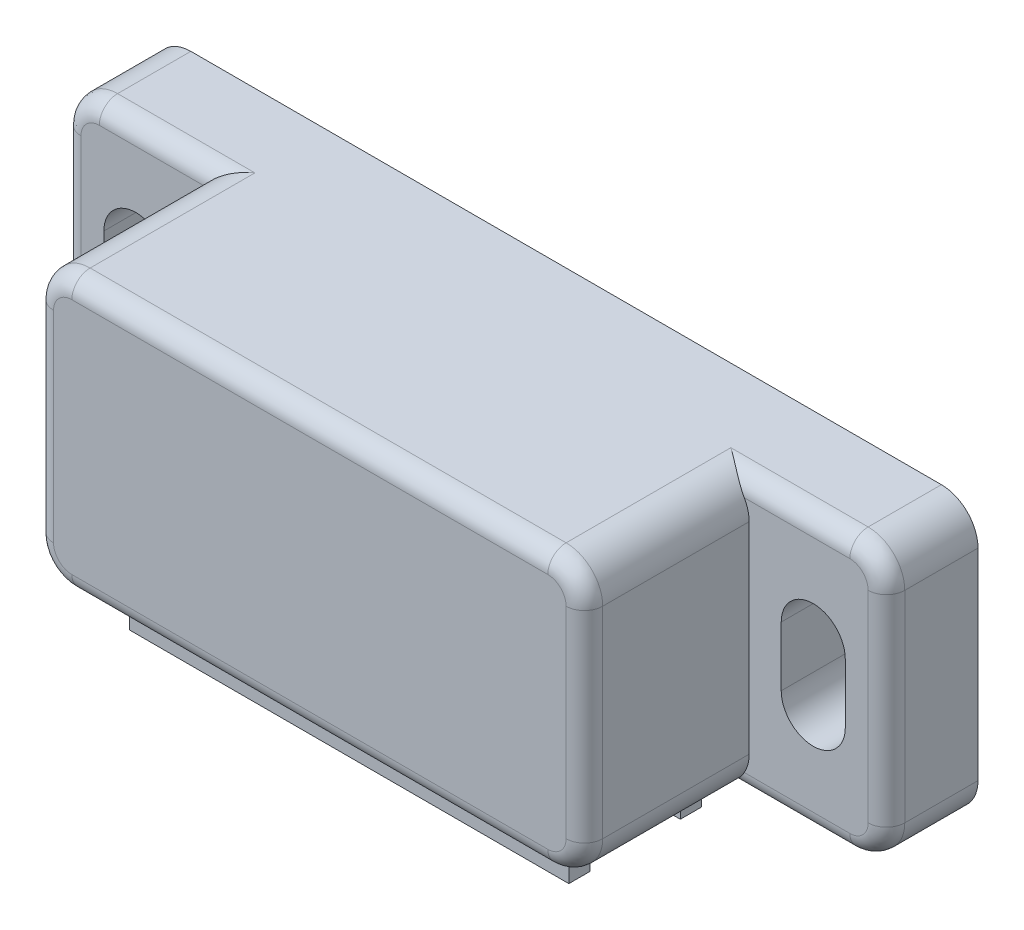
ISO-10303-21;
HEADER;
FILE_DESCRIPTION(('STEP AP214'),'2;1');
FILE_NAME('part.step','',(''),(''),'','','');
FILE_SCHEMA(('AUTOMOTIVE_DESIGN { 1 0 10303 214 1 1 1 1 }'));
ENDSEC;
DATA;
#1=APPLICATION_CONTEXT('core data for automotive mechanical design processes');
#2=APPLICATION_PROTOCOL_DEFINITION('international standard','automotive_design',2000,#1);
#3=PRODUCT_CONTEXT('',#1,'mechanical');
#4=PRODUCT('Part','Part','',(#3));
#5=PRODUCT_RELATED_PRODUCT_CATEGORY('part','',(#4));
#6=PRODUCT_DEFINITION_FORMATION('','',#4);
#7=PRODUCT_DEFINITION_CONTEXT('part definition',#1,'design');
#8=PRODUCT_DEFINITION('design','',#6,#7);
#9=PRODUCT_DEFINITION_SHAPE('','',#8);
#10=(LENGTH_UNIT() NAMED_UNIT(*) SI_UNIT(.MILLI.,.METRE.));
#11=(NAMED_UNIT(*) PLANE_ANGLE_UNIT() SI_UNIT($,.RADIAN.));
#12=(NAMED_UNIT(*) SI_UNIT($,.STERADIAN.) SOLID_ANGLE_UNIT());
#13=UNCERTAINTY_MEASURE_WITH_UNIT(LENGTH_MEASURE(1.E-05),#10,'distance_accuracy_value','');
#14=(GEOMETRIC_REPRESENTATION_CONTEXT(3) GLOBAL_UNCERTAINTY_ASSIGNED_CONTEXT((#13)) GLOBAL_UNIT_ASSIGNED_CONTEXT((#10,
#11,#12)) REPRESENTATION_CONTEXT('',''));
#15=CARTESIAN_POINT('',(0.,0.,0.));
#16=DIRECTION('',(0.,0.,1.));
#17=DIRECTION('',(1.,0.,0.));
#18=AXIS2_PLACEMENT_3D('',#15,#16,#17);
#19=CARTESIAN_POINT('',(14.,3.75,13.));
#20=DIRECTION('',(0.,1.,0.));
#21=DIRECTION('',(-1.,0.,0.));
#22=AXIS2_PLACEMENT_3D('',#19,#20,#21);
#23=CYLINDRICAL_SURFACE('',#22,1.);
#24=CARTESIAN_POINT('',(14.,5.5,13.));
#25=DIRECTION('',(0.,-1.,0.));
#26=DIRECTION('',(1.,0.,0.));
#27=AXIS2_PLACEMENT_3D('',#24,#25,#26);
#28=CIRCLE('',#27,1.);
#29=CARTESIAN_POINT('',(14.,5.5,14.));
#30=VERTEX_POINT('',#29);
#31=CARTESIAN_POINT('',(15.,5.5,13.));
#32=VERTEX_POINT('',#31);
#33=EDGE_CURVE('E1221',#30,#32,#28,.F.);
#34=ORIENTED_EDGE('',*,*,#33,.F.);
#35=DIRECTION('',(0.,1.,0.));
#36=VECTOR('',#35,1.);
#37=CARTESIAN_POINT('',(14.,0.,14.));
#38=LINE('',#37,#36);
#39=CARTESIAN_POINT('',(14.,-5.50000000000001,14.));
#40=VERTEX_POINT('',#39);
#41=EDGE_CURVE('E1226',#40,#30,#38,.T.);
#42=ORIENTED_EDGE('',*,*,#41,.F.);
#43=CARTESIAN_POINT('',(14.,-5.50000000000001,13.));
#44=DIRECTION('',(0.,-1.,0.));
#45=DIRECTION('',(1.,0.,0.));
#46=AXIS2_PLACEMENT_3D('',#43,#44,#45);
#47=CIRCLE('',#46,1.);
#48=CARTESIAN_POINT('',(15.,-5.50000000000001,13.));
#49=VERTEX_POINT('',#48);
#50=EDGE_CURVE('E188',#49,#40,#47,.T.);
#51=ORIENTED_EDGE('',*,*,#50,.F.);
#52=DIRECTION('',(0.,1.,0.));
#53=VECTOR('',#52,1.);
#54=CARTESIAN_POINT('',(15.,7.5,13.));
#55=LINE('',#54,#53);
#56=EDGE_CURVE('E212',#49,#32,#55,.T.);
#57=ORIENTED_EDGE('',*,*,#56,.T.);
#58=EDGE_LOOP('',(#34,#42,#51,#57));
#59=FACE_BOUND('',#58,.T.);
#60=ADVANCED_FACE('F15',(#59),#23,.T.);
#61=CARTESIAN_POINT('',(-14.,-3.75,13.));
#62=DIRECTION('',(0.,-1.,0.));
#63=DIRECTION('',(1.,0.,0.));
#64=AXIS2_PLACEMENT_3D('',#61,#62,#63);
#65=CYLINDRICAL_SURFACE('',#64,1.);
#66=CARTESIAN_POINT('',(-14.,5.5,13.));
#67=DIRECTION('',(0.,-1.,0.));
#68=DIRECTION('',(1.,0.,0.));
#69=AXIS2_PLACEMENT_3D('',#66,#67,#68);
#70=CIRCLE('',#69,1.);
#71=CARTESIAN_POINT('',(-15.,5.5,13.));
#72=VERTEX_POINT('',#71);
#73=CARTESIAN_POINT('',(-13.9999999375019,5.49999999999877,13.9999999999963));
#74=VERTEX_POINT('',#73);
#75=EDGE_CURVE('E209',#72,#74,#70,.F.);
#76=ORIENTED_EDGE('',*,*,#75,.F.);
#77=DIRECTION('',(0.,1.,0.));
#78=VECTOR('',#77,1.);
#79=CARTESIAN_POINT('',(-15.,-7.50000000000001,13.));
#80=LINE('',#79,#78);
#81=CARTESIAN_POINT('',(-15.,-5.5,13.));
#82=VERTEX_POINT('',#81);
#83=EDGE_CURVE('E206',#72,#82,#80,.F.);
#84=ORIENTED_EDGE('',*,*,#83,.T.);
#85=CARTESIAN_POINT('',(-14.,-5.5,13.));
#86=DIRECTION('',(0.,-1.,0.));
#87=DIRECTION('',(1.,0.,0.));
#88=AXIS2_PLACEMENT_3D('',#85,#86,#87);
#89=CIRCLE('',#88,1.);
#90=CARTESIAN_POINT('',(-14.,-5.50000000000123,13.9999999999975));
#91=VERTEX_POINT('',#90);
#92=EDGE_CURVE('E19',#91,#82,#89,.T.);
#93=ORIENTED_EDGE('',*,*,#92,.F.);
#94=DIRECTION('',(0.,1.,0.));
#95=VECTOR('',#94,1.);
#96=CARTESIAN_POINT('',(-14.,0.,14.));
#97=LINE('',#96,#95);
#98=EDGE_CURVE('E240',#74,#91,#97,.F.);
#99=ORIENTED_EDGE('',*,*,#98,.F.);
#100=EDGE_LOOP('',(#76,#84,#93,#99));
#101=FACE_BOUND('',#100,.T.);
#102=ADVANCED_FACE('F208',(#101),#65,.T.);
#103=CARTESIAN_POINT('',(-12.9999997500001,-5.5,12.9999999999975));
#104=DIRECTION('',(-2.45326992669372E-12,-2.4532699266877E-12,1.));
#105=DIRECTION('',(1.,0.,2.45326992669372E-12));
#106=AXIS2_PLACEMENT_3D('',#103,#104,#105);
#107=DEGENERATE_TOROIDAL_SURFACE('',#106,0.999999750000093,1.,.T.);
#108=ORIENTED_EDGE('',*,*,#92,.T.);
#109=CARTESIAN_POINT('',(-12.9999997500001,-5.5,13.0000000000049));
#110=DIRECTION('',(-2.45326992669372E-12,-2.4532699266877E-12,1.));
#111=DIRECTION('',(1.,0.,2.45326992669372E-12));
#112=AXIS2_PLACEMENT_3D('',#109,#110,#111);
#113=CIRCLE('',#112,1.99999975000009);
#114=CARTESIAN_POINT('',(-12.9999999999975,-7.49999987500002,13.));
#115=VERTEX_POINT('',#114);
#116=EDGE_CURVE('E201',#115,#82,#113,.F.);
#117=ORIENTED_EDGE('',*,*,#116,.F.);
#118=CARTESIAN_POINT('',(-12.9999999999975,-6.49999975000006,12.9999999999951));
#119=DIRECTION('',(-0.999999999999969,2.49997454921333E-07,-2.45326931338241E-12));
#120=DIRECTION('',(-2.49997454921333E-07,-0.999999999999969,0.));
#121=AXIS2_PLACEMENT_3D('',#118,#119,#120);
#122=CIRCLE('',#121,1.);
#123=CARTESIAN_POINT('',(-12.9999998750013,-6.50000000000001,13.9999999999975));
#124=VERTEX_POINT('',#123);
#125=EDGE_CURVE('E547',#124,#115,#122,.F.);
#126=ORIENTED_EDGE('',*,*,#125,.F.);
#127=CARTESIAN_POINT('',(-12.9999997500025,-5.50000000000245,13.9999999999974));
#128=DIRECTION('',(-2.45326992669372E-12,-2.4532699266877E-12,1.));
#129=DIRECTION('',(1.,0.,2.45326992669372E-12));
#130=AXIS2_PLACEMENT_3D('',#127,#128,#129);
#131=CIRCLE('',#130,1.00000024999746);
#132=EDGE_CURVE('E203',#91,#124,#131,.T.);
#133=ORIENTED_EDGE('',*,*,#132,.F.);
#134=EDGE_LOOP('',(#108,#117,#126,#133));
#135=FACE_BOUND('',#134,.T.);
#136=ADVANCED_FACE('F198',(#135),#107,.T.);
#137=CARTESIAN_POINT('',(12.,-5.50000000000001,13.));
#138=DIRECTION('',(0.,1.,0.));
#139=DIRECTION('',(-1.,0.,0.));
#140=AXIS2_PLACEMENT_3D('',#137,#138,#139);
#141=CIRCLE('',#140,1.);
#142=TRIMMED_CURVE('',#141,(PARAMETER_VALUE(-3.14159265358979)),
(PARAMETER_VALUE(3.14159265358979)),.T.,.PARAMETER.);
#143=CARTESIAN_POINT('',(13.,-5.50000000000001,13.));
#144=DIRECTION('',(0.,0.,-1.));
#145=AXIS1_PLACEMENT('',#143,#144);
#146=SURFACE_OF_REVOLUTION('',#142,#145);
#147=ORIENTED_EDGE('',*,*,#50,.T.);
#148=CARTESIAN_POINT('',(13.,-5.50000000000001,14.));
#149=DIRECTION('',(0.,0.,-1.));
#150=DIRECTION('',(1.,0.,0.));
#151=AXIS2_PLACEMENT_3D('',#148,#149,#150);
#152=CIRCLE('',#151,0.999999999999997);
#153=CARTESIAN_POINT('',(13.,-6.50000000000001,14.));
#154=VERTEX_POINT('',#153);
#155=EDGE_CURVE('E239',#154,#40,#152,.F.);
#156=ORIENTED_EDGE('',*,*,#155,.F.);
#157=CARTESIAN_POINT('',(13.,-6.50000000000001,13.));
#158=DIRECTION('',(-1.,0.,0.));
#159=DIRECTION('',(0.,-1.,0.));
#160=AXIS2_PLACEMENT_3D('',#157,#158,#159);
#161=CIRCLE('',#160,1.);
#162=CARTESIAN_POINT('',(13.,-7.50000000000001,13.));
#163=VERTEX_POINT('',#162);
#164=EDGE_CURVE('E268',#163,#154,#161,.T.);
#165=ORIENTED_EDGE('',*,*,#164,.F.);
#166=CARTESIAN_POINT('',(13.,-5.50000000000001,13.));
#167=DIRECTION('',(0.,0.,1.));
#168=DIRECTION('',(1.,0.,0.));
#169=AXIS2_PLACEMENT_3D('',#166,#167,#168);
#170=CIRCLE('',#169,2.);
#171=EDGE_CURVE('E541',#49,#163,#170,.F.);
#172=ORIENTED_EDGE('',*,*,#171,.F.);
#173=EDGE_LOOP('',(#147,#156,#165,#172));
#174=FACE_BOUND('',#173,.T.);
#175=ADVANCED_FACE('F275',(#174),#146,.F.);
#176=CARTESIAN_POINT('',(0.,-8.50000000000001,8.225));
#177=DIRECTION('',(0.,1.,0.));
#178=DIRECTION('',(0.,0.,1.));
#179=AXIS2_PLACEMENT_3D('',#176,#177,#178);
#180=PLANE('',#179);
#181=DIRECTION('',(0.,0.,-1.));
#182=VECTOR('',#181,1.);
#183=CARTESIAN_POINT('',(12.,-8.50000000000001,11.85));
#184=LINE('',#183,#182);
#185=CARTESIAN_POINT('',(12.,-8.50000000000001,10.69));
#186=VERTEX_POINT('',#185);
#187=CARTESIAN_POINT('',(12.,-8.50000000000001,5.76));
#188=VERTEX_POINT('',#187);
#189=EDGE_CURVE('E514',#186,#188,#184,.T.);
#190=ORIENTED_EDGE('',*,*,#189,.F.);
#191=DIRECTION('',(-1.,0.,0.));
#192=VECTOR('',#191,1.);
#193=CARTESIAN_POINT('',(12.,-8.5,10.69));
#194=LINE('',#193,#192);
#195=CARTESIAN_POINT('',(-12.,-8.5,10.69));
#196=VERTEX_POINT('',#195);
#197=EDGE_CURVE('E246',#196,#186,#194,.F.);
#198=ORIENTED_EDGE('',*,*,#197,.F.);
#199=DIRECTION('',(0.,0.,1.));
#200=VECTOR('',#199,1.);
#201=CARTESIAN_POINT('',(-12.,-8.5,4.6));
#202=LINE('',#201,#200);
#203=CARTESIAN_POINT('',(-12.,-8.50000000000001,5.76));
#204=VERTEX_POINT('',#203);
#205=EDGE_CURVE('E267',#204,#196,#202,.T.);
#206=ORIENTED_EDGE('',*,*,#205,.F.);
#207=DIRECTION('',(1.,0.,0.));
#208=VECTOR('',#207,1.);
#209=CARTESIAN_POINT('',(-12.,-8.50000000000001,5.76));
#210=LINE('',#209,#208);
#211=EDGE_CURVE('E261',#188,#204,#210,.F.);
#212=ORIENTED_EDGE('',*,*,#211,.F.);
#213=EDGE_LOOP('',(#190,#198,#206,#212));
#214=FACE_BOUND('',#213,.T.);
#215=ADVANCED_FACE('F280',(#214),#180,.F.);
#216=CARTESIAN_POINT('',(-12.,-8.5,5.76));
#217=DIRECTION('',(0.,0.,1.));
#218=DIRECTION('',(1.,0.,0.));
#219=AXIS2_PLACEMENT_3D('',#216,#217,#218);
#220=PLANE('',#219);
#221=ORIENTED_EDGE('',*,*,#211,.T.);
#222=DIRECTION('',(0.,1.,0.));
#223=VECTOR('',#222,1.);
#224=CARTESIAN_POINT('',(-12.,-7.50000000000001,5.76));
#225=LINE('',#224,#223);
#226=CARTESIAN_POINT('',(-12.,-9.7,5.76));
#227=VERTEX_POINT('',#226);
#228=EDGE_CURVE('E523',#227,#204,#225,.T.);
#229=ORIENTED_EDGE('',*,*,#228,.F.);
#230=DIRECTION('',(1.,0.,0.));
#231=VECTOR('',#230,1.);
#232=CARTESIAN_POINT('',(0.,-9.7,5.76));
#233=LINE('',#232,#231);
#234=CARTESIAN_POINT('',(12.,-9.70000000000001,5.76));
#235=VERTEX_POINT('',#234);
#236=EDGE_CURVE('E243',#227,#235,#233,.T.);
#237=ORIENTED_EDGE('',*,*,#236,.T.);
#238=DIRECTION('',(0.,1.,0.));
#239=VECTOR('',#238,1.);
#240=CARTESIAN_POINT('',(12.,-7.50000000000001,5.76));
#241=LINE('',#240,#239);
#242=EDGE_CURVE('E511',#188,#235,#241,.F.);
#243=ORIENTED_EDGE('',*,*,#242,.F.);
#244=EDGE_LOOP('',(#221,#229,#237,#243));
#245=FACE_BOUND('',#244,.T.);
#246=ADVANCED_FACE('F821',(#245),#220,.T.);
#247=CARTESIAN_POINT('',(0.,-9.7,11.27));
#248=DIRECTION('',(0.,1.,0.));
#249=DIRECTION('',(0.,0.,1.));
#250=AXIS2_PLACEMENT_3D('',#247,#248,#249);
#251=PLANE('',#250);
#252=DIRECTION('',(0.,0.,1.));
#253=VECTOR('',#252,1.);
#254=CARTESIAN_POINT('',(-12.,-9.7,4.6));
#255=LINE('',#254,#253);
#256=CARTESIAN_POINT('',(-12.,-9.70000000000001,10.69));
#257=VERTEX_POINT('',#256);
#258=CARTESIAN_POINT('',(-12.,-9.7,11.85));
#259=VERTEX_POINT('',#258);
#260=EDGE_CURVE('E529',#257,#259,#255,.T.);
#261=ORIENTED_EDGE('',*,*,#260,.F.);
#262=DIRECTION('',(-1.,0.,0.));
#263=VECTOR('',#262,1.);
#264=CARTESIAN_POINT('',(12.,-9.70000000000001,10.69));
#265=LINE('',#264,#263);
#266=CARTESIAN_POINT('',(12.,-9.70000000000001,10.69));
#267=VERTEX_POINT('',#266);
#268=EDGE_CURVE('E255',#267,#257,#265,.T.);
#269=ORIENTED_EDGE('',*,*,#268,.F.);
#270=DIRECTION('',(0.,0.,-1.));
#271=VECTOR('',#270,1.);
#272=CARTESIAN_POINT('',(12.,-9.70000000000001,11.85));
#273=LINE('',#272,#271);
#274=CARTESIAN_POINT('',(12.,-9.70000000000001,11.85));
#275=VERTEX_POINT('',#274);
#276=EDGE_CURVE('E502',#275,#267,#273,.T.);
#277=ORIENTED_EDGE('',*,*,#276,.F.);
#278=DIRECTION('',(1.,0.,0.));
#279=VECTOR('',#278,1.);
#280=CARTESIAN_POINT('',(-12.,-9.7,11.85));
#281=LINE('',#280,#279);
#282=EDGE_CURVE('E517',#259,#275,#281,.T.);
#283=ORIENTED_EDGE('',*,*,#282,.F.);
#284=EDGE_LOOP('',(#261,#269,#277,#283));
#285=FACE_BOUND('',#284,.T.);
#286=ADVANCED_FACE('F829',(#285),#251,.F.);
#287=CARTESIAN_POINT('',(12.,-8.50000000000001,10.69));
#288=DIRECTION('',(0.,0.,-1.));
#289=DIRECTION('',(-1.,0.,0.));
#290=AXIS2_PLACEMENT_3D('',#287,#288,#289);
#291=PLANE('',#290);
#292=ORIENTED_EDGE('',*,*,#197,.T.);
#293=DIRECTION('',(0.,1.,0.));
#294=VECTOR('',#293,1.);
#295=CARTESIAN_POINT('',(12.,-7.50000000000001,10.69));
#296=LINE('',#295,#294);
#297=EDGE_CURVE('E499',#267,#186,#296,.T.);
#298=ORIENTED_EDGE('',*,*,#297,.F.);
#299=ORIENTED_EDGE('',*,*,#268,.T.);
#300=DIRECTION('',(0.,1.,0.));
#301=VECTOR('',#300,1.);
#302=CARTESIAN_POINT('',(-12.,-7.50000000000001,10.69));
#303=LINE('',#302,#301);
#304=EDGE_CURVE('E532',#196,#257,#303,.F.);
#305=ORIENTED_EDGE('',*,*,#304,.F.);
#306=EDGE_LOOP('',(#292,#298,#299,#305));
#307=FACE_BOUND('',#306,.T.);
#308=ADVANCED_FACE('F836',(#307),#291,.T.);
#309=CARTESIAN_POINT('',(0.,-9.7,5.18));
#310=DIRECTION('',(0.,1.,0.));
#311=DIRECTION('',(0.,0.,1.));
#312=AXIS2_PLACEMENT_3D('',#309,#310,#311);
#313=PLANE('',#312);
#314=DIRECTION('',(-1.,0.,0.));
#315=VECTOR('',#314,1.);
#316=CARTESIAN_POINT('',(12.,-9.70000000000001,4.6));
#317=LINE('',#316,#315);
#318=CARTESIAN_POINT('',(12.,-9.70000000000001,4.6));
#319=VERTEX_POINT('',#318);
#320=CARTESIAN_POINT('',(-12.,-9.70000000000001,4.6));
#321=VERTEX_POINT('',#320);
#322=EDGE_CURVE('E488',#319,#321,#317,.T.);
#323=ORIENTED_EDGE('',*,*,#322,.F.);
#324=DIRECTION('',(0.,0.,-1.));
#325=VECTOR('',#324,1.);
#326=CARTESIAN_POINT('',(12.,-9.70000000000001,11.85));
#327=LINE('',#326,#325);
#328=EDGE_CURVE('E508',#235,#319,#327,.T.);
#329=ORIENTED_EDGE('',*,*,#328,.F.);
#330=ORIENTED_EDGE('',*,*,#236,.F.);
#331=DIRECTION('',(0.,0.,1.));
#332=VECTOR('',#331,1.);
#333=CARTESIAN_POINT('',(-12.,-9.7,4.6));
#334=LINE('',#333,#332);
#335=EDGE_CURVE('E526',#321,#227,#334,.T.);
#336=ORIENTED_EDGE('',*,*,#335,.F.);
#337=EDGE_LOOP('',(#323,#329,#330,#336));
#338=FACE_BOUND('',#337,.T.);
#339=ADVANCED_FACE('F845',(#338),#313,.F.);
#340=CARTESIAN_POINT('',(-12.9999997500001,5.5,12.9999999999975));
#341=DIRECTION('',(-2.4532699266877E-12,-2.45326992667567E-12,1.));
#342=DIRECTION('',(1.,0.,2.4532699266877E-12));
#343=AXIS2_PLACEMENT_3D('',#340,#341,#342);
#344=DEGENERATE_TOROIDAL_SURFACE('',#343,0.999999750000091,0.999999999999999,.T.);
#345=CARTESIAN_POINT('',(-12.999999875,6.49999975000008,13.));
#346=DIRECTION('',(0.999999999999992,1.24999954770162E-07,2.45327023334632E-12));
#347=DIRECTION('',(-1.24999954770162E-07,0.999999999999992,0.));
#348=AXIS2_PLACEMENT_3D('',#345,#346,#347);
#349=CIRCLE('',#348,0.999999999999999);
#350=CARTESIAN_POINT('',(-12.999999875,7.49999987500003,13.0000000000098));
#351=VERTEX_POINT('',#350);
#352=CARTESIAN_POINT('',(-12.9999998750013,6.5,14.));
#353=VERTEX_POINT('',#352);
#354=EDGE_CURVE('E363',#351,#353,#349,.T.);
#355=ORIENTED_EDGE('',*,*,#354,.F.);
#356=CARTESIAN_POINT('',(-12.9999997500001,5.5,13.0000000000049));
#357=DIRECTION('',(-2.4532699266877E-12,-2.45326992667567E-12,1.));
#358=DIRECTION('',(1.,0.,2.4532699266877E-12));
#359=AXIS2_PLACEMENT_3D('',#356,#357,#358);
#360=CIRCLE('',#359,1.99999975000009);
#361=EDGE_CURVE('E1264',#72,#351,#360,.F.);
#362=ORIENTED_EDGE('',*,*,#361,.F.);
#363=ORIENTED_EDGE('',*,*,#75,.T.);
#364=CARTESIAN_POINT('',(-12.9999997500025,5.49999999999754,13.9999999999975));
#365=DIRECTION('',(-2.4532699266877E-12,-2.45326992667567E-12,1.));
#366=DIRECTION('',(1.,0.,2.4532699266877E-12));
#367=AXIS2_PLACEMENT_3D('',#364,#365,#366);
#368=CIRCLE('',#367,1.00000000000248);
#369=EDGE_CURVE('E241',#353,#74,#368,.T.);
#370=ORIENTED_EDGE('',*,*,#369,.F.);
#371=EDGE_LOOP('',(#355,#362,#363,#370));
#372=FACE_BOUND('',#371,.T.);
#373=ADVANCED_FACE('F17',(#372),#344,.T.);
#374=CARTESIAN_POINT('',(0.,0.,14.));
#375=DIRECTION('',(0.,0.,1.));
#376=DIRECTION('',(1.,0.,0.));
#377=AXIS2_PLACEMENT_3D('',#374,#375,#376);
#378=PLANE('',#377);
#379=ORIENTED_EDGE('',*,*,#41,.T.);
#380=CARTESIAN_POINT('',(13.,5.5,14.));
#381=DIRECTION('',(0.,0.,-1.));
#382=DIRECTION('',(0.,1.,0.));
#383=AXIS2_PLACEMENT_3D('',#380,#381,#382);
#384=CIRCLE('',#383,1.);
#385=CARTESIAN_POINT('',(13.,6.5,14.));
#386=VERTEX_POINT('',#385);
#387=EDGE_CURVE('E1224',#386,#30,#384,.T.);
#388=ORIENTED_EDGE('',*,*,#387,.F.);
#389=DIRECTION('',(1.,0.,0.));
#390=VECTOR('',#389,1.);
#391=CARTESIAN_POINT('',(-11.25,6.5,14.));
#392=LINE('',#391,#390);
#393=EDGE_CURVE('E419',#353,#386,#392,.T.);
#394=ORIENTED_EDGE('',*,*,#393,.F.);
#395=ORIENTED_EDGE('',*,*,#369,.T.);
#396=ORIENTED_EDGE('',*,*,#98,.T.);
#397=ORIENTED_EDGE('',*,*,#132,.T.);
#398=DIRECTION('',(-1.,0.,0.));
#399=VECTOR('',#398,1.);
#400=CARTESIAN_POINT('',(11.25,-6.50000000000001,14.));
#401=LINE('',#400,#399);
#402=EDGE_CURVE('E264',#154,#124,#401,.T.);
#403=ORIENTED_EDGE('',*,*,#402,.F.);
#404=ORIENTED_EDGE('',*,*,#155,.T.);
#405=EDGE_LOOP('',(#379,#388,#394,#395,#396,#397,#403,#404));
#406=FACE_BOUND('',#405,.T.);
#407=ADVANCED_FACE('F862',(#406),#378,.T.);
#408=CARTESIAN_POINT('',(12.,5.5,13.));
#409=DIRECTION('',(0.,1.,0.));
#410=DIRECTION('',(-1.,0.,0.));
#411=AXIS2_PLACEMENT_3D('',#408,#409,#410);
#412=CIRCLE('',#411,1.);
#413=TRIMMED_CURVE('',#412,(PARAMETER_VALUE(-3.14159265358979)),
(PARAMETER_VALUE(3.14159265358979)),.T.,.PARAMETER.);
#414=CARTESIAN_POINT('',(13.,5.5,13.));
#415=DIRECTION('',(0.,0.,-1.));
#416=AXIS1_PLACEMENT('',#414,#415);
#417=SURFACE_OF_REVOLUTION('',#413,#416);
#418=CARTESIAN_POINT('',(13.,6.5,13.));
#419=DIRECTION('',(1.,0.,0.));
#420=DIRECTION('',(0.,1.,0.));
#421=AXIS2_PLACEMENT_3D('',#418,#419,#420);
#422=CIRCLE('',#421,1.);
#423=CARTESIAN_POINT('',(13.,7.5,13.));
#424=VERTEX_POINT('',#423);
#425=EDGE_CURVE('E413',#386,#424,#422,.F.);
#426=ORIENTED_EDGE('',*,*,#425,.F.);
#427=ORIENTED_EDGE('',*,*,#387,.T.);
#428=ORIENTED_EDGE('',*,*,#33,.T.);
#429=CARTESIAN_POINT('',(13.,5.5,13.));
#430=DIRECTION('',(0.,0.,-1.));
#431=DIRECTION('',(-1.,0.,0.));
#432=AXIS2_PLACEMENT_3D('',#429,#430,#431);
#433=CIRCLE('',#432,2.);
#434=EDGE_CURVE('E410',#424,#32,#433,.T.);
#435=ORIENTED_EDGE('',*,*,#434,.F.);
#436=EDGE_LOOP('',(#426,#427,#428,#435));
#437=FACE_BOUND('',#436,.T.);
#438=ADVANCED_FACE('F869',(#437),#417,.F.);
#439=CARTESIAN_POINT('',(15.,7.5,14.));
#440=DIRECTION('',(-1.,0.,0.));
#441=DIRECTION('',(0.,0.,1.));
#442=AXIS2_PLACEMENT_3D('',#439,#440,#441);
#443=PLANE('',#442);
#444=DIRECTION('',(0.,0.,1.));
#445=VECTOR('',#444,1.);
#446=CARTESIAN_POINT('',(15.,-5.50000000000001,7.));
#447=LINE('',#446,#445);
#448=CARTESIAN_POINT('',(15.,-5.50000000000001,5.));
#449=VERTEX_POINT('',#448);
#450=EDGE_CURVE('E1201',#449,#49,#447,.T.);
#451=ORIENTED_EDGE('',*,*,#450,.F.);
#452=DIRECTION('',(0.,1.,0.));
#453=VECTOR('',#452,1.);
#454=CARTESIAN_POINT('',(15.,0.,5.));
#455=LINE('',#454,#453);
#456=CARTESIAN_POINT('',(15.,5.5,5.));
#457=VERTEX_POINT('',#456);
#458=EDGE_CURVE('E349',#457,#449,#455,.F.);
#459=ORIENTED_EDGE('',*,*,#458,.F.);
#460=DIRECTION('',(0.,0.,-1.));
#461=VECTOR('',#460,1.);
#462=CARTESIAN_POINT('',(15.,5.5,7.));
#463=LINE('',#462,#461);
#464=EDGE_CURVE('E407',#32,#457,#463,.T.);
#465=ORIENTED_EDGE('',*,*,#464,.F.);
#466=ORIENTED_EDGE('',*,*,#56,.F.);
#467=EDGE_LOOP('',(#451,#459,#465,#466));
#468=FACE_BOUND('',#467,.T.);
#469=ADVANCED_FACE('F878',(#468),#443,.F.);
#470=CARTESIAN_POINT('',(-15.,-7.50000000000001,14.));
#471=DIRECTION('',(1.,0.,0.));
#472=DIRECTION('',(0.,0.,-1.));
#473=AXIS2_PLACEMENT_3D('',#470,#471,#472);
#474=PLANE('',#473);
#475=DIRECTION('',(0.,0.,1.));
#476=VECTOR('',#475,1.);
#477=CARTESIAN_POINT('',(-15.,5.5,7.));
#478=LINE('',#477,#476);
#479=CARTESIAN_POINT('',(-15.,5.5,5.));
#480=VERTEX_POINT('',#479);
#481=EDGE_CURVE('E1266',#480,#72,#478,.T.);
#482=ORIENTED_EDGE('',*,*,#481,.F.);
#483=DIRECTION('',(0.,1.,0.));
#484=VECTOR('',#483,1.);
#485=CARTESIAN_POINT('',(-15.,0.,5.));
#486=LINE('',#485,#484);
#487=CARTESIAN_POINT('',(-15.,-5.5,5.));
#488=VERTEX_POINT('',#487);
#489=EDGE_CURVE('E218',#488,#480,#486,.T.);
#490=ORIENTED_EDGE('',*,*,#489,.F.);
#491=DIRECTION('',(0.,0.,-1.));
#492=VECTOR('',#491,1.);
#493=CARTESIAN_POINT('',(-15.,-5.5,7.));
#494=LINE('',#493,#492);
#495=EDGE_CURVE('E215',#82,#488,#494,.T.);
#496=ORIENTED_EDGE('',*,*,#495,.F.);
#497=ORIENTED_EDGE('',*,*,#83,.F.);
#498=EDGE_LOOP('',(#482,#490,#496,#497));
#499=FACE_BOUND('',#498,.T.);
#500=ADVANCED_FACE('F216',(#499),#474,.F.);
#501=CARTESIAN_POINT('',(-13.,-5.5,7.));
#502=DIRECTION('',(0.,0.,-1.));
#503=DIRECTION('',(-1.,0.,0.));
#504=AXIS2_PLACEMENT_3D('',#501,#502,#503);
#505=CYLINDRICAL_SURFACE('',#504,2.);
#506=CARTESIAN_POINT('',(-13.,-7.5,4.));
#507=CARTESIAN_POINT('',(-13.0000000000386,-7.50000000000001,4.00000122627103));
#508=CARTESIAN_POINT('',(-13.0000001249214,-7.49999999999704,4.00000245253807));
#509=CARTESIAN_POINT('',(-13.0000005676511,-7.4999999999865,4.00000487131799));
#510=CARTESIAN_POINT('',(-13.0000008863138,-7.49999999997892,4.00000606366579));
#511=CARTESIAN_POINT('',(-13.0000016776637,-7.49999999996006,4.00000842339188));
#512=CARTESIAN_POINT('',(-13.0000021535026,-7.49999999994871,4.00000958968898));
#513=CARTESIAN_POINT('',(-13.0000032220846,-7.49999999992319,4.0000118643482));
#514=CARTESIAN_POINT('',(-13.0000038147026,-7.49999999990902,4.00001297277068));
#515=CARTESIAN_POINT('',(-13.000005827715,-7.49999999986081,4.00001640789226));
#516=CARTESIAN_POINT('',(-13.0000074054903,-7.49999999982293,4.00001864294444));
#517=CARTESIAN_POINT('',(-13.0000108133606,-7.49999999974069,4.00002287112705));
#518=CARTESIAN_POINT('',(-13.0000126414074,-7.49999999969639,4.00002486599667));
#519=CARTESIAN_POINT('',(-13.0000191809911,-7.49999999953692,4.00003153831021));
#520=CARTESIAN_POINT('',(-13.0000242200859,-7.49999999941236,4.00003589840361));
#521=CARTESIAN_POINT('',(-13.0000346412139,-7.49999999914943,4.00004374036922));
#522=CARTESIAN_POINT('',(-13.0000400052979,-7.49999999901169,4.00004724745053));
#523=CARTESIAN_POINT('',(-13.0000608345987,-7.49999999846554,4.00006045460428));
#524=CARTESIAN_POINT('',(-13.0000766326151,-7.49999999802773,4.00006961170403));
#525=CARTESIAN_POINT('',(-13.0001073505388,-7.49999999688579,4.00008584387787));
#526=CARTESIAN_POINT('',(-13.0001222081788,-7.4999999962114,4.00009303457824));
#527=CARTESIAN_POINT('',(-13.0002198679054,-7.49999999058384,4.00014439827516));
#528=CARTESIAN_POINT('',(-13.0002938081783,-7.49999998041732,4.00020354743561));
#529=CARTESIAN_POINT('',(-13.0005684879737,-7.49999992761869,4.00041345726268));
#530=CARTESIAN_POINT('',(-13.000775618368,-7.49999985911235,4.00055299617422));
#531=CARTESIAN_POINT('',(-13.0015335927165,-7.49999949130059,4.0010730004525));
#532=CARTESIAN_POINT('',(-13.0020779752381,-7.49999899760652,4.00146484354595));
#533=CARTESIAN_POINT('',(-13.0041780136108,-7.49999623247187,4.00296714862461));
#534=CARTESIAN_POINT('',(-13.0057405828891,-7.49999236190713,4.00406539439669));
#535=CARTESIAN_POINT('',(-13.0435402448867,-7.49985457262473,4.03064384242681));
#536=CARTESIAN_POINT('',(-13.079680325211,-7.49874088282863,4.05630224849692));
#537=CARTESIAN_POINT('',(-13.1509867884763,-7.49460280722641,4.10673507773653));
#538=CARTESIAN_POINT('',(-13.1861530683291,-7.49163091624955,4.13151463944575));
#539=CARTESIAN_POINT('',(-13.2594664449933,-7.48347073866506,4.18309282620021));
#540=CARTESIAN_POINT('',(-13.2976044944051,-7.47811093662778,4.20987794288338));
#541=CARTESIAN_POINT('',(-13.3740047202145,-7.46510363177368,4.26332095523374));
#542=CARTESIAN_POINT('',(-13.4122657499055,-7.45743961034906,4.28997647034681));
#543=CARTESIAN_POINT('',(-13.4811334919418,-7.44152125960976,4.33769956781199));
#544=CARTESIAN_POINT('',(-13.5117802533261,-7.43367231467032,4.35884476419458));
#545=CARTESIAN_POINT('',(-13.5728341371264,-7.41647204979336,4.40073790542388));
#546=CARTESIAN_POINT('',(-13.6032415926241,-7.40712347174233,4.42148649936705));
#547=CARTESIAN_POINT('',(-13.6931425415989,-7.37709939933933,4.48241577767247));
#548=CARTESIAN_POINT('',(-13.7523346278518,-7.3542111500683,4.52198973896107));
#549=CARTESIAN_POINT('',(-13.8523961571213,-7.30982880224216,4.5875841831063));
#550=CARTESIAN_POINT('',(-13.893572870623,-7.28987619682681,4.61419040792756));
#551=CARTESIAN_POINT('',(-13.9753254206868,-7.24667851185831,4.66604380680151));
#552=CARTESIAN_POINT('',(-14.0158983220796,-7.22342101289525,4.6912853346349));
#553=CARTESIAN_POINT('',(-14.0975694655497,-7.1726439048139,4.74084748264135));
#554=CARTESIAN_POINT('',(-14.1386316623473,-7.1449985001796,4.7650995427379));
#555=CARTESIAN_POINT('',(-14.2194016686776,-7.08605068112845,4.81113581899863));
#556=CARTESIAN_POINT('',(-14.259111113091,-7.0547528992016,4.83292309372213));
#557=CARTESIAN_POINT('',(-14.3544979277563,-6.97337846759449,4.88266898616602));
#558=CARTESIAN_POINT('',(-14.4092909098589,-6.92120282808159,4.90897322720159));
#559=CARTESIAN_POINT('',(-14.5136732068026,-6.80941643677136,4.95279902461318));
#560=CARTESIAN_POINT('',(-14.5633056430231,-6.74987827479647,4.97039892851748));
#561=CARTESIAN_POINT('',(-14.6461134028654,-6.63757140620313,4.9917624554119));
#562=CARTESIAN_POINT('',(-14.680522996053,-6.58613650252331,4.99769952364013));
#563=CARTESIAN_POINT('',(-14.7445683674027,-6.47995863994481,5.00120803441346));
#564=CARTESIAN_POINT('',(-14.7741998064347,-6.42521273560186,4.99877191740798));
#565=CARTESIAN_POINT('',(-14.8280082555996,-6.31378043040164,4.98412383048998));
#566=CARTESIAN_POINT('',(-14.852142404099,-6.25708250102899,4.97183820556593));
#567=CARTESIAN_POINT('',(-14.8941865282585,-6.1447090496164,4.93660269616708));
#568=CARTESIAN_POINT('',(-14.9121023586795,-6.08903261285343,4.91366289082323));
#569=CARTESIAN_POINT('',(-14.9399881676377,-5.98867278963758,4.86100184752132));
#570=CARTESIAN_POINT('',(-14.9506949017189,-5.94350850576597,4.83257573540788));
#571=CARTESIAN_POINT('',(-14.9682130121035,-5.85784083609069,4.76843538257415));
#572=CARTESIAN_POINT('',(-14.9750244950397,-5.81733732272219,4.73272134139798));
#573=CARTESIAN_POINT('',(-14.9854567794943,-5.74354500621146,4.65614245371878));
#574=CARTESIAN_POINT('',(-14.989164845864,-5.71008023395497,4.61545821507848));
#575=CARTESIAN_POINT('',(-14.9946032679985,-5.64990812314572,4.52925214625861));
#576=CARTESIAN_POINT('',(-14.9963333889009,-5.62320158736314,4.48372974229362));
#577=CARTESIAN_POINT('',(-14.9986864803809,-5.57634129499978,4.38710817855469));
#578=CARTESIAN_POINT('',(-14.9992617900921,-5.55649661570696,4.33585785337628));
#579=CARTESIAN_POINT('',(-14.9998985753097,-5.5254568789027,4.2307968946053));
#580=CARTESIAN_POINT('',(-14.9999599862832,-5.51426290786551,4.17698594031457));
#581=CARTESIAN_POINT('',(-15.0000121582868,-5.50066866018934,4.06695053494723));
#582=CARTESIAN_POINT('',(-15.0000011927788,-5.49848531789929,4.01069914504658));
#583=CARTESIAN_POINT('',(-14.9999982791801,-5.50357133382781,3.8986235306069));
#584=CARTESIAN_POINT('',(-15.0000063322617,-5.5108412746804,3.84279933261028));
#585=CARTESIAN_POINT('',(-14.9997348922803,-5.53465741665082,3.73302540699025));
#586=CARTESIAN_POINT('',(-14.9994547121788,-5.55122573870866,3.67908047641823));
#587=CARTESIAN_POINT('',(-14.9979377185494,-5.59318255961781,3.57474297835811));
#588=CARTESIAN_POINT('',(-14.9967008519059,-5.61857154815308,3.52435060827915));
#589=CARTESIAN_POINT('',(-14.9923434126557,-5.67727622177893,3.42881356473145));
#590=CARTESIAN_POINT('',(-14.9892314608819,-5.71055520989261,3.38364599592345));
#591=CARTESIAN_POINT('',(-14.980076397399,-5.78401039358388,3.29966600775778));
#592=CARTESIAN_POINT('',(-14.9740343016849,-5.82418419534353,3.26085139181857));
#593=CARTESIAN_POINT('',(-14.9582785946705,-5.90856236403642,3.19186973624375));
#594=CARTESIAN_POINT('',(-14.9486898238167,-5.95259471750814,3.16146395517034));
#595=CARTESIAN_POINT('',(-14.9251620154,-6.04403557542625,3.1084351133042));
#596=CARTESIAN_POINT('',(-14.9112245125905,-6.09144288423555,3.08580931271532));
#597=CARTESIAN_POINT('',(-14.8792402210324,-6.18620332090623,3.04919533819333));
#598=CARTESIAN_POINT('',(-14.8613418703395,-6.23350803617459,3.03495010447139));
#599=CARTESIAN_POINT('',(-14.8213002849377,-6.32794857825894,3.01372221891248));
#600=CARTESIAN_POINT('',(-14.7991549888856,-6.37508431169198,3.00674310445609));
#601=CARTESIAN_POINT('',(-14.7496923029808,-6.47036710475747,2.99923551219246));
#602=CARTESIAN_POINT('',(-14.7221592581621,-6.51842994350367,2.99907815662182));
#603=CARTESIAN_POINT('',(-14.6634605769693,-6.61172928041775,3.00516169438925));
#604=CARTESIAN_POINT('',(-14.6322983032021,-6.65696833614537,3.01139670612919));
#605=CARTESIAN_POINT('',(-14.5503933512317,-6.76609246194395,3.03373105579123));
#606=CARTESIAN_POINT('',(-14.497718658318,-6.82783638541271,3.05322446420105));
#607=CARTESIAN_POINT('',(-14.3868793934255,-6.94328168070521,3.10140901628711));
#608=CARTESIAN_POINT('',(-14.3286617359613,-6.99688912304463,3.13019709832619));
#609=CARTESIAN_POINT('',(-14.225548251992,-7.08150099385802,3.18535959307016));
#610=CARTESIAN_POINT('',(-14.1815007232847,-7.11462598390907,3.21014279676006));
#611=CARTESIAN_POINT('',(-14.0918942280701,-7.17652509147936,3.26246435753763));
#612=CARTESIAN_POINT('',(-14.0463331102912,-7.20529266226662,3.2900067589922));
#613=CARTESIAN_POINT('',(-13.9559499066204,-7.25749050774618,3.34607686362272));
#614=CARTESIAN_POINT('',(-13.9111718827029,-7.28108899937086,3.37452029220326));
#615=CARTESIAN_POINT('',(-13.8210106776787,-7.32439898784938,3.43283208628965));
#616=CARTESIAN_POINT('',(-13.7756310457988,-7.34412720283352,3.46269359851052));
#617=CARTESIAN_POINT('',(-13.6770523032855,-7.38277107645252,3.52841924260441));
#618=CARTESIAN_POINT('',(-13.623746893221,-7.40106984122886,3.56448826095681));
#619=CARTESIAN_POINT('',(-13.5429011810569,-7.42511466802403,3.61976897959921));
#620=CARTESIAN_POINT('',(-13.5155735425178,-7.43261009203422,3.63855340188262));
#621=CARTESIAN_POINT('',(-13.4607389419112,-7.44641219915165,3.67640993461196));
#622=CARTESIAN_POINT('',(-13.4332317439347,-7.45271669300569,3.69548250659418));
#623=CARTESIAN_POINT('',(-13.3713282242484,-7.46553945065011,3.73855129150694));
#624=CARTESIAN_POINT('',(-13.3369027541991,-7.47172836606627,3.76260388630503));
#625=CARTESIAN_POINT('',(-13.268190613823,-7.48223952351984,3.81077036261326));
#626=CARTESIAN_POINT('',(-13.2339047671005,-7.48657507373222,3.83488251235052));
#627=CARTESIAN_POINT('',(-13.1680086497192,-7.4931829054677,3.88128324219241));
#628=CARTESIAN_POINT('',(-13.1364051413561,-7.49559316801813,3.90356239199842));
#629=CARTESIAN_POINT('',(-13.0723310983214,-7.49895688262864,3.9488900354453));
#630=CARTESIAN_POINT('',(-13.0398608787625,-7.49986798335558,3.97194270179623));
#631=CARTESIAN_POINT('',(-13.0057408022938,-7.49999236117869,3.99593447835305));
#632=CARTESIAN_POINT('',(-13.004178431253,-7.49999623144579,3.99703256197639));
#633=CARTESIAN_POINT('',(-13.002078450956,-7.49999899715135,3.99853481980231));
#634=CARTESIAN_POINT('',(-13.0015339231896,-7.49999949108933,3.99892676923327));
#635=CARTESIAN_POINT('',(-13.0007757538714,-7.49999985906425,3.99944690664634));
#636=CARTESIAN_POINT('',(-13.0005685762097,-7.49999992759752,3.99958647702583));
#637=CARTESIAN_POINT('',(-13.0002938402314,-7.49999998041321,3.99979643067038));
#638=CARTESIAN_POINT('',(-13.0002198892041,-7.49999999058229,3.99985558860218));
#639=CARTESIAN_POINT('',(-13.0001222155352,-7.49999999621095,3.99990695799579));
#640=CARTESIAN_POINT('',(-13.0001073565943,-7.49999999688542,3.99991414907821));
#641=CARTESIAN_POINT('',(-13.0000766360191,-7.49999999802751,3.99993038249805));
#642=CARTESIAN_POINT('',(-13.0000608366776,-7.49999999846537,3.99993954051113));
#643=CARTESIAN_POINT('',(-13.0000400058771,-7.49999999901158,3.99995274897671));
#644=CARTESIAN_POINT('',(-13.0000346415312,-7.49999999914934,3.99995625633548));
#645=CARTESIAN_POINT('',(-13.0000242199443,-7.4999999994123,3.99996409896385));
#646=CARTESIAN_POINT('',(-13.0000191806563,-7.49999999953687,3.99996845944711));
#647=CARTESIAN_POINT('',(-13.0000126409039,-7.49999999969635,3.99997513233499));
#648=CARTESIAN_POINT('',(-13.000010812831,-7.49999999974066,3.99997712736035));
#649=CARTESIAN_POINT('',(-13.0000074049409,-7.4999999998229,3.99998135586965));
#650=CARTESIAN_POINT('',(-13.0000058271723,-7.49999999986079,3.99998359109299));
#651=CARTESIAN_POINT('',(-13.0000038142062,-7.499999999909,3.99998702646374));
#652=CARTESIAN_POINT('',(-13.0000032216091,-7.49999999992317,3.99998813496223));
#653=CARTESIAN_POINT('',(-13.0000021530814,-7.4999999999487,3.99999040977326));
#654=CARTESIAN_POINT('',(-13.0000016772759,-7.49999999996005,3.99999157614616));
#655=CARTESIAN_POINT('',(-13.000000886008,-7.49999999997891,3.99999393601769));
#656=CARTESIAN_POINT('',(-13.0000005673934,-7.4999999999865,3.99999512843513));
#657=CARTESIAN_POINT('',(-13.000000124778,-7.49999999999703,3.99999754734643));
#658=CARTESIAN_POINT('',(-12.9999999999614,-7.5,3.99999877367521));
#659=CARTESIAN_POINT('',(-13.,-7.5,4.));
#660=B_SPLINE_CURVE_WITH_KNOTS('',3,(#506,#507,#508,#509,#510,#511,#512,#513,#514,#515,#516,
#517,#518,#519,#520,#521,#522,#523,#524,#525,#526,#527,#528,#529,#530,#531,#532,#533,#534,#535,
#536,#537,#538,#539,#540,#541,#542,#543,#544,#545,#546,#547,#548,#549,#550,#551,#552,#553,#554,
#555,#556,#557,#558,#559,#560,#561,#562,#563,#564,#565,#566,#567,#568,#569,#570,#571,#572,#573,
#574,#575,#576,#577,#578,#579,#580,#581,#582,#583,#584,#585,#586,#587,#588,#589,#590,#591,#592,
#593,#594,#595,#596,#597,#598,#599,#600,#601,#602,#603,#604,#605,#606,#607,#608,#609,#610,#611,
#612,#613,#614,#615,#616,#617,#618,#619,#620,#621,#622,#623,#624,#625,#626,#627,#628,#629,#630,
#631,#632,#633,#634,#635,#636,#637,#638,#639,#640,#641,#642,#643,#644,#645,#646,#647,#648,#649,
#650,#651,#652,#653,#654,#655,#656,#657,#658,#659),.UNSPECIFIED.,.T.,.F.,(4,2,2,2,2,2,2,2,2,2,2,
2,2,2,2,2,2,2,2,2,2,2,2,2,2,2,2,2,2,2,2,2,2,2,2,2,2,2,2,2,2,2,2,2,2,2,2,2,2,2,2,2,2,2,2,2,2,2,2,
2,2,2,2,2,2,2,2,2,2,2,2,2,2,2,2,2,4),(0.,3.67567449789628E-06,7.36692773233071E-06,
1.11372128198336E-05,1.49034840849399E-05,2.3075501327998E-05,3.11842425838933E-05,
5.1084205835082E-05,7.02941666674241E-05,0.000125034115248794,0.000174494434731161,
0.000456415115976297,0.00120714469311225,0.00321759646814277,0.00894897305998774,
0.141879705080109,0.27121495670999,0.411892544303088,0.553603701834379,0.667726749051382,
0.781643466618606,1.00569437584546,1.16437781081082,1.32367415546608,1.48886051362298,
1.65383958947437,1.89329881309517,2.1305615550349,2.31634845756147,2.50230313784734,
2.68966151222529,2.87684300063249,3.03931254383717,3.20177763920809,3.35950429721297,
3.51724968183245,3.68138166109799,3.84553425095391,4.0136166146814,4.18170933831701,
4.35020366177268,4.51870734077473,4.68644216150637,4.85411886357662,5.01638180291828,
5.17858754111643,5.33551626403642,5.49252134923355,5.65805779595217,5.82344206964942,
6.07246934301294,6.32418260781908,6.50523187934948,6.6865505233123,6.86057133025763,
7.03382302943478,7.23435035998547,7.33632523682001,7.43848578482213,7.56579243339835,
7.6921689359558,7.80837367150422,7.92780811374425,7.93353872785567,7.93554971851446,
7.93630061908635,7.9365825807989,7.93663204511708,7.9366867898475,7.9367060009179,
7.93672590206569,7.93673401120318,7.93674218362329,7.93674595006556,7.9367497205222,
7.93675341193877,7.93675708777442),.UNSPECIFIED.);
#661=CARTESIAN_POINT('',(-13.,-7.50000000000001,4.));
#662=VERTEX_POINT('',#661);
#663=CARTESIAN_POINT('',(-14.7320508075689,-6.5,5.));
#664=VERTEX_POINT('',#663);
#665=EDGE_CURVE('E222',#662,#664,#660,.T.);
#666=ORIENTED_EDGE('',*,*,#665,.F.);
#667=DIRECTION('',(0.,0.,-1.));
#668=VECTOR('',#667,1.);
#669=CARTESIAN_POINT('',(-13.,-7.50000000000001,0.));
#670=LINE('',#669,#668);
#671=EDGE_CURVE('E227',#115,#662,#670,.T.);
#672=ORIENTED_EDGE('',*,*,#671,.F.);
#673=ORIENTED_EDGE('',*,*,#116,.T.);
#674=ORIENTED_EDGE('',*,*,#495,.T.);
#675=CARTESIAN_POINT('',(-13.,-5.5,5.));
#676=DIRECTION('',(0.,0.,-1.));
#677=DIRECTION('',(-1.,0.,0.));
#678=AXIS2_PLACEMENT_3D('',#675,#676,#677);
#679=CIRCLE('',#678,2.);
#680=EDGE_CURVE('E343',#664,#488,#679,.T.);
#681=ORIENTED_EDGE('',*,*,#680,.F.);
#682=EDGE_LOOP('',(#666,#672,#673,#674,#681));
#683=FACE_BOUND('',#682,.T.);
#684=ADVANCED_FACE('F225',(#683),#505,.T.);
#685=CARTESIAN_POINT('',(1.875,-6.50000000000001,4.));
#686=DIRECTION('',(1.,0.,0.));
#687=DIRECTION('',(0.,1.,0.));
#688=AXIS2_PLACEMENT_3D('',#685,#686,#687);
#689=CYLINDRICAL_SURFACE('',#688,1.);
#690=CARTESIAN_POINT('',(-20.5,-6.50000000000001,4.));
#691=DIRECTION('',(-1.,0.,0.));
#692=DIRECTION('',(0.,-1.,0.));
#693=AXIS2_PLACEMENT_3D('',#690,#691,#692);
#694=CIRCLE('',#693,1.);
#695=CARTESIAN_POINT('',(-20.5,-7.50000000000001,4.));
#696=VERTEX_POINT('',#695);
#697=CARTESIAN_POINT('',(-20.5,-6.5,5.));
#698=VERTEX_POINT('',#697);
#699=EDGE_CURVE('E584',#696,#698,#694,.T.);
#700=ORIENTED_EDGE('',*,*,#699,.F.);
#701=DIRECTION('',(1.,0.,0.));
#702=VECTOR('',#701,1.);
#703=CARTESIAN_POINT('',(22.5,-7.50000000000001,4.));
#704=LINE('',#703,#702);
#705=EDGE_CURVE('E553',#662,#696,#704,.F.);
#706=ORIENTED_EDGE('',*,*,#705,.F.);
#707=ORIENTED_EDGE('',*,*,#665,.T.);
#708=DIRECTION('',(1.,0.,0.));
#709=VECTOR('',#708,1.);
#710=CARTESIAN_POINT('',(-18.75,-6.5,5.));
#711=LINE('',#710,#709);
#712=EDGE_CURVE('E345',#698,#664,#711,.T.);
#713=ORIENTED_EDGE('',*,*,#712,.F.);
#714=EDGE_LOOP('',(#700,#706,#707,#713));
#715=FACE_BOUND('',#714,.T.);
#716=ADVANCED_FACE('F902',(#715),#689,.T.);
#717=CARTESIAN_POINT('',(20.625,-6.50000000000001,4.));
#718=DIRECTION('',(1.,0.,0.));
#719=DIRECTION('',(0.,1.,0.));
#720=AXIS2_PLACEMENT_3D('',#717,#718,#719);
#721=CYLINDRICAL_SURFACE('',#720,1.);
#722=CARTESIAN_POINT('',(20.5,-6.50000000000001,4.));
#723=DIRECTION('',(-1.,0.,0.));
#724=DIRECTION('',(0.,-1.,0.));
#725=AXIS2_PLACEMENT_3D('',#722,#723,#724);
#726=CIRCLE('',#725,1.);
#727=CARTESIAN_POINT('',(20.5,-6.50000000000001,5.));
#728=VERTEX_POINT('',#727);
#729=CARTESIAN_POINT('',(20.5,-7.50000000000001,4.));
#730=VERTEX_POINT('',#729);
#731=EDGE_CURVE('E485',#728,#730,#726,.F.);
#732=ORIENTED_EDGE('',*,*,#731,.F.);
#733=DIRECTION('',(1.,0.,0.));
#734=VECTOR('',#733,1.);
#735=CARTESIAN_POINT('',(18.75,-6.50000000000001,5.));
#736=LINE('',#735,#734);
#737=CARTESIAN_POINT('',(14.7320508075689,-6.50000000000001,5.));
#738=VERTEX_POINT('',#737);
#739=EDGE_CURVE('E590',#738,#728,#736,.T.);
#740=ORIENTED_EDGE('',*,*,#739,.F.);
#741=CARTESIAN_POINT('',(13.,-7.50000000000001,4.));
#742=CARTESIAN_POINT('',(13.0000000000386,-7.50000000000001,4.00000122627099));
#743=CARTESIAN_POINT('',(13.0000001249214,-7.49999999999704,4.000002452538));
#744=CARTESIAN_POINT('',(13.0000005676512,-7.49999999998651,4.00000487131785));
#745=CARTESIAN_POINT('',(13.0000008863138,-7.49999999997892,4.00000606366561));
#746=CARTESIAN_POINT('',(13.0000016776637,-7.49999999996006,4.00000842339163));
#747=CARTESIAN_POINT('',(13.0000021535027,-7.49999999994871,4.00000958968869));
#748=CARTESIAN_POINT('',(13.0000032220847,-7.49999999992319,4.00001186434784));
#749=CARTESIAN_POINT('',(13.0000038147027,-7.49999999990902,4.00001297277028));
#750=CARTESIAN_POINT('',(13.0000058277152,-7.49999999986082,4.00001640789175));
#751=CARTESIAN_POINT('',(13.0000074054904,-7.49999999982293,4.00001864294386));
#752=CARTESIAN_POINT('',(13.0000108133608,-7.49999999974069,4.00002287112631));
#753=CARTESIAN_POINT('',(13.0000126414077,-7.49999999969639,4.00002486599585));
#754=CARTESIAN_POINT('',(13.0000191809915,-7.49999999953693,4.00003153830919));
#755=CARTESIAN_POINT('',(13.0000242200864,-7.49999999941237,4.00003589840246));
#756=CARTESIAN_POINT('',(13.0000346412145,-7.49999999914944,4.00004374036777));
#757=CARTESIAN_POINT('',(13.0000400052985,-7.49999999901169,4.00004724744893));
#758=CARTESIAN_POINT('',(13.0000608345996,-7.49999999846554,4.00006045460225));
#759=CARTESIAN_POINT('',(13.0000766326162,-7.49999999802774,4.00006961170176));
#760=CARTESIAN_POINT('',(13.0001073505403,-7.49999999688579,4.00008584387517));
#761=CARTESIAN_POINT('',(13.0001222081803,-7.49999999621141,4.00009303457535));
#762=CARTESIAN_POINT('',(13.0002198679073,-7.49999999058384,4.00014439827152));
#763=CARTESIAN_POINT('',(13.0002938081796,-7.49999998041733,4.00020354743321));
#764=CARTESIAN_POINT('',(13.0005684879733,-7.49999992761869,4.00041345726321));
#765=CARTESIAN_POINT('',(13.0007756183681,-7.49999985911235,4.00055299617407));
#766=CARTESIAN_POINT('',(13.0015335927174,-7.49999949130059,4.00107300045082));
#767=CARTESIAN_POINT('',(13.0020779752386,-7.49999899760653,4.0014648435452));
#768=CARTESIAN_POINT('',(13.0041780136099,-7.49999623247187,4.00296714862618));
#769=CARTESIAN_POINT('',(13.0057405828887,-7.49999236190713,4.00406539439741));
#770=CARTESIAN_POINT('',(13.0435402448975,-7.49985457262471,4.03064384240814));
#771=CARTESIAN_POINT('',(13.0796803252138,-7.49874088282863,4.0563022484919));
#772=CARTESIAN_POINT('',(13.1509867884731,-7.49460280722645,4.10673507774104));
#773=CARTESIAN_POINT('',(13.1861530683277,-7.49163091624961,4.13151463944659));
#774=CARTESIAN_POINT('',(13.2594664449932,-7.4834707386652,4.18309282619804));
#775=CARTESIAN_POINT('',(13.2976044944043,-7.47811093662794,4.20987794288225));
#776=CARTESIAN_POINT('',(13.3740047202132,-7.46510363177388,4.26332095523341));
#777=CARTESIAN_POINT('',(13.4122657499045,-7.45743961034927,4.28997647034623));
#778=CARTESIAN_POINT('',(13.4811334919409,-7.44152125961,4.33769956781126));
#779=CARTESIAN_POINT('',(13.5117802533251,-7.43367231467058,4.35884476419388));
#780=CARTESIAN_POINT('',(13.5728341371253,-7.41647204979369,4.40073790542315));
#781=CARTESIAN_POINT('',(13.6032415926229,-7.4071234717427,4.42148649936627));
#782=CARTESIAN_POINT('',(13.6931425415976,-7.37709939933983,4.48241577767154));
#783=CARTESIAN_POINT('',(13.7523346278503,-7.35421115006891,4.52198973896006));
#784=CARTESIAN_POINT('',(13.8523961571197,-7.30982880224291,4.58758418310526));
#785=CARTESIAN_POINT('',(13.8935728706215,-7.28987619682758,4.61419040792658));
#786=CARTESIAN_POINT('',(13.9753254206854,-7.24667851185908,4.66604380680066));
#787=CARTESIAN_POINT('',(14.0158983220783,-7.22342101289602,4.6912853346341));
#788=CARTESIAN_POINT('',(14.0975694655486,-7.17264390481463,4.7408474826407));
#789=CARTESIAN_POINT('',(14.1386316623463,-7.1449985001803,4.76509954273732));
#790=CARTESIAN_POINT('',(14.2194016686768,-7.08605068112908,4.81113581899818));
#791=CARTESIAN_POINT('',(14.2591111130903,-7.05475289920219,4.83292309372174));
#792=CARTESIAN_POINT('',(14.3544979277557,-6.97337846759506,4.88266898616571));
#793=CARTESIAN_POINT('',(14.4092909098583,-6.92120282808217,4.90897322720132));
#794=CARTESIAN_POINT('',(14.5136732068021,-6.80941643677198,4.95279902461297));
#795=CARTESIAN_POINT('',(14.5633056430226,-6.74987827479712,4.97039892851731));
#796=CARTESIAN_POINT('',(14.646113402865,-6.63757140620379,4.99176245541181));
#797=CARTESIAN_POINT('',(14.6805229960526,-6.58613650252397,4.99769952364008));
#798=CARTESIAN_POINT('',(14.7445683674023,-6.47995863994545,5.00120803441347));
#799=CARTESIAN_POINT('',(14.7741998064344,-6.42521273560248,4.99877191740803));
#800=CARTESIAN_POINT('',(14.8280082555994,-6.31378043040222,4.98412383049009));
#801=CARTESIAN_POINT('',(14.8521424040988,-6.25708250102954,4.97183820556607));
#802=CARTESIAN_POINT('',(14.8941865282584,-6.1447090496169,4.93660269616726));
#803=CARTESIAN_POINT('',(14.9121023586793,-6.08903261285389,4.91366289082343));
#804=CARTESIAN_POINT('',(14.9399881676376,-5.98867278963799,4.86100184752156));
#805=CARTESIAN_POINT('',(14.9506949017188,-5.94350850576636,4.83257573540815));
#806=CARTESIAN_POINT('',(14.9682130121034,-5.85784083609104,4.76843538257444));
#807=CARTESIAN_POINT('',(14.9750244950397,-5.81733732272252,4.73272134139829));
#808=CARTESIAN_POINT('',(14.9854567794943,-5.74354500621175,4.65614245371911));
#809=CARTESIAN_POINT('',(14.989164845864,-5.71008023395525,4.61545821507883));
#810=CARTESIAN_POINT('',(14.9946032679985,-5.64990812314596,4.52925214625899));
#811=CARTESIAN_POINT('',(14.9963333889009,-5.62320158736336,4.48372974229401));
#812=CARTESIAN_POINT('',(14.9986864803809,-5.57634129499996,4.38710817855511));
#813=CARTESIAN_POINT('',(14.9992617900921,-5.55649661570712,4.33585785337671));
#814=CARTESIAN_POINT('',(14.9998985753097,-5.52545687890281,4.23079689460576));
#815=CARTESIAN_POINT('',(14.9999599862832,-5.5142629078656,4.17698594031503));
#816=CARTESIAN_POINT('',(15.0000121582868,-5.50066866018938,4.0669505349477));
#817=CARTESIAN_POINT('',(15.0000011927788,-5.4984853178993,4.01069914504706));
#818=CARTESIAN_POINT('',(14.9999982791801,-5.50357133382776,3.89862353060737));
#819=CARTESIAN_POINT('',(15.0000063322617,-5.51084127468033,3.84279933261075));
#820=CARTESIAN_POINT('',(14.9997348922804,-5.53465741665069,3.73302540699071));
#821=CARTESIAN_POINT('',(14.9994547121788,-5.55122573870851,3.67908047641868));
#822=CARTESIAN_POINT('',(14.9979377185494,-5.59318255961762,3.57474297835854));
#823=CARTESIAN_POINT('',(14.9967008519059,-5.61857154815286,3.52435060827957));
#824=CARTESIAN_POINT('',(14.9923434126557,-5.67727622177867,3.42881356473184));
#825=CARTESIAN_POINT('',(14.989231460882,-5.71055520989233,3.38364599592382));
#826=CARTESIAN_POINT('',(14.980076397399,-5.78401039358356,3.29966600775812));
#827=CARTESIAN_POINT('',(14.9740343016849,-5.82418419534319,3.26085139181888));
#828=CARTESIAN_POINT('',(14.9582785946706,-5.90856236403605,3.19186973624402));
#829=CARTESIAN_POINT('',(14.9486898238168,-5.95259471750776,3.16146395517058));
#830=CARTESIAN_POINT('',(14.9251620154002,-6.04403557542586,3.1084351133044));
#831=CARTESIAN_POINT('',(14.9112245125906,-6.09144288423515,3.0858093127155));
#832=CARTESIAN_POINT('',(14.8792402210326,-6.18620332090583,3.04919533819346));
#833=CARTESIAN_POINT('',(14.8613418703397,-6.23350803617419,3.0349501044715));
#834=CARTESIAN_POINT('',(14.8213002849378,-6.32794857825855,3.01372221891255));
#835=CARTESIAN_POINT('',(14.7991549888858,-6.37508431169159,3.00674310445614));
#836=CARTESIAN_POINT('',(14.7496923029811,-6.47036710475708,2.99923551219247));
#837=CARTESIAN_POINT('',(14.7221592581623,-6.51842994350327,2.99907815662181));
#838=CARTESIAN_POINT('',(14.6634605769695,-6.61172928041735,3.0051616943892));
#839=CARTESIAN_POINT('',(14.6322983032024,-6.65696833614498,3.01139670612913));
#840=CARTESIAN_POINT('',(14.550393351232,-6.76609246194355,3.03373105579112));
#841=CARTESIAN_POINT('',(14.4977186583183,-6.82783638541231,3.0532244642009));
#842=CARTESIAN_POINT('',(14.386879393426,-6.94328168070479,3.10140901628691));
#843=CARTESIAN_POINT('',(14.3286617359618,-6.99688912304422,3.13019709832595));
#844=CARTESIAN_POINT('',(14.2255482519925,-7.08150099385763,3.18535959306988));
#845=CARTESIAN_POINT('',(14.1815007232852,-7.11462598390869,3.21014279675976));
#846=CARTESIAN_POINT('',(14.0918942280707,-7.176525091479,3.2624643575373));
#847=CARTESIAN_POINT('',(14.0463331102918,-7.20529266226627,3.29000675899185));
#848=CARTESIAN_POINT('',(13.9559499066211,-7.25749050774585,3.34607686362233));
#849=CARTESIAN_POINT('',(13.9111718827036,-7.28108899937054,3.37452029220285));
#850=CARTESIAN_POINT('',(13.8210106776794,-7.32439898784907,3.43283208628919));
#851=CARTESIAN_POINT('',(13.7756310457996,-7.34412720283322,3.46269359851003));
#852=CARTESIAN_POINT('',(13.6770523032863,-7.38277107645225,3.5284192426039));
#853=CARTESIAN_POINT('',(13.6237468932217,-7.40106984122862,3.5644882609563));
#854=CARTESIAN_POINT('',(13.5429011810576,-7.42511466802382,3.6197689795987));
#855=CARTESIAN_POINT('',(13.5155735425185,-7.43261009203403,3.63855340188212));
#856=CARTESIAN_POINT('',(13.4607389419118,-7.4464121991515,3.67640993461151));
#857=CARTESIAN_POINT('',(13.4332317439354,-7.45271669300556,3.69548250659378));
#858=CARTESIAN_POINT('',(13.3713282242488,-7.46553945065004,3.73855129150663));
#859=CARTESIAN_POINT('',(13.3369027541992,-7.47172836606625,3.76260388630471));
#860=CARTESIAN_POINT('',(13.268190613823,-7.48223952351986,3.81077036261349));
#861=CARTESIAN_POINT('',(13.2339047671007,-7.48657507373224,3.83488251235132));
#862=CARTESIAN_POINT('',(13.1680086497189,-7.4931829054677,3.88128324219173));
#863=CARTESIAN_POINT('',(13.1364051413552,-7.49559316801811,3.9035623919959));
#864=CARTESIAN_POINT('',(13.072331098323,-7.49895688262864,3.94889003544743));
#865=CARTESIAN_POINT('',(13.0398608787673,-7.49986798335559,3.9719427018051));
#866=CARTESIAN_POINT('',(13.0057408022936,-7.49999236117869,3.99593447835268));
#867=CARTESIAN_POINT('',(13.0041784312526,-7.49999623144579,3.99703256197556));
#868=CARTESIAN_POINT('',(13.0020784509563,-7.49999899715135,3.99853481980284));
#869=CARTESIAN_POINT('',(13.0015339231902,-7.49999949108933,3.99892676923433));
#870=CARTESIAN_POINT('',(13.0007757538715,-7.49999985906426,3.99944690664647));
#871=CARTESIAN_POINT('',(13.0005685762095,-7.49999992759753,3.99958647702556));
#872=CARTESIAN_POINT('',(13.0002938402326,-7.49999998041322,3.9997964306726));
#873=CARTESIAN_POINT('',(13.0002198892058,-7.4999999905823,3.99985558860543));
#874=CARTESIAN_POINT('',(13.0001222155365,-7.49999999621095,3.99990695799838));
#875=CARTESIAN_POINT('',(13.0001073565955,-7.49999999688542,3.99991414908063));
#876=CARTESIAN_POINT('',(13.0000766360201,-7.49999999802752,3.99993038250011));
#877=CARTESIAN_POINT('',(13.0000608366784,-7.49999999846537,3.999939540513));
#878=CARTESIAN_POINT('',(13.0000400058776,-7.49999999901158,3.9999527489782));
#879=CARTESIAN_POINT('',(13.0000346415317,-7.49999999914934,3.99995625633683));
#880=CARTESIAN_POINT('',(13.0000242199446,-7.4999999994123,3.99996409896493));
#881=CARTESIAN_POINT('',(13.0000191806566,-7.49999999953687,3.99996845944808));
#882=CARTESIAN_POINT('',(13.0000126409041,-7.49999999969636,3.99997513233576));
#883=CARTESIAN_POINT('',(13.0000108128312,-7.49999999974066,3.99997712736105));
#884=CARTESIAN_POINT('',(13.000007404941,-7.49999999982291,3.99998135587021));
#885=CARTESIAN_POINT('',(13.0000058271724,-7.4999999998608,3.99998359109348));
#886=CARTESIAN_POINT('',(13.0000038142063,-7.49999999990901,3.99998702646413));
#887=CARTESIAN_POINT('',(13.0000032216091,-7.49999999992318,3.99998813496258));
#888=CARTESIAN_POINT('',(13.0000021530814,-7.4999999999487,3.99999040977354));
#889=CARTESIAN_POINT('',(13.0000016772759,-7.49999999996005,3.9999915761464));
#890=CARTESIAN_POINT('',(13.000000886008,-7.49999999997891,3.99999393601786));
#891=CARTESIAN_POINT('',(13.0000005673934,-7.4999999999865,3.99999512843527));
#892=CARTESIAN_POINT('',(13.000000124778,-7.49999999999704,3.99999754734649));
#893=CARTESIAN_POINT('',(12.9999999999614,-7.50000000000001,3.99999877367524));
#894=CARTESIAN_POINT('',(13.,-7.50000000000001,4.));
#895=B_SPLINE_CURVE_WITH_KNOTS('',3,(#741,#742,#743,#744,#745,#746,#747,#748,#749,#750,#751,
#752,#753,#754,#755,#756,#757,#758,#759,#760,#761,#762,#763,#764,#765,#766,#767,#768,#769,#770,
#771,#772,#773,#774,#775,#776,#777,#778,#779,#780,#781,#782,#783,#784,#785,#786,#787,#788,#789,
#790,#791,#792,#793,#794,#795,#796,#797,#798,#799,#800,#801,#802,#803,#804,#805,#806,#807,#808,
#809,#810,#811,#812,#813,#814,#815,#816,#817,#818,#819,#820,#821,#822,#823,#824,#825,#826,#827,
#828,#829,#830,#831,#832,#833,#834,#835,#836,#837,#838,#839,#840,#841,#842,#843,#844,#845,#846,
#847,#848,#849,#850,#851,#852,#853,#854,#855,#856,#857,#858,#859,#860,#861,#862,#863,#864,#865,
#866,#867,#868,#869,#870,#871,#872,#873,#874,#875,#876,#877,#878,#879,#880,#881,#882,#883,#884,
#885,#886,#887,#888,#889,#890,#891,#892,#893,#894),.UNSPECIFIED.,.T.,.F.,(4,2,2,2,2,2,2,2,2,2,2,
2,2,2,2,2,2,2,2,2,2,2,2,2,2,2,2,2,2,2,2,2,2,2,2,2,2,2,2,2,2,2,2,2,2,2,2,2,2,2,2,2,2,2,2,2,2,2,2,
2,2,2,2,2,2,2,2,2,2,2,2,2,2,2,2,2,4),(0.,3.67567439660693E-06,7.36692753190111E-06,
1.11372125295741E-05,1.49034837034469E-05,2.3075500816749E-05,3.11842419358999E-05,
5.10842051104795E-05,7.02941657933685E-05,0.000125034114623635,0.000174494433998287,
0.000456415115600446,0.00120714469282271,0.00321759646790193,0.00894897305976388,
0.141879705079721,0.271214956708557,0.411892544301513,0.553603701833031,0.667726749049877,
0.781643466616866,1.00569437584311,1.16437781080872,1.32367415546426,1.48886051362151,
1.65383958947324,1.8932988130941,2.13056155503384,2.31634845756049,2.50230313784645,
2.68966151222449,2.87684300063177,3.03931254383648,3.20177763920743,3.3595042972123,
3.51724968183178,3.68138166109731,3.84553425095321,4.0136166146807,4.18170933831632,
4.35020366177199,4.51870734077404,4.68644216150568,4.85411886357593,5.0163818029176,
5.17858754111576,5.33551626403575,5.49252134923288,5.65805779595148,5.8234420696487,
6.07246934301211,6.32418260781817,6.50523187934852,6.68655052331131,6.86057133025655,
7.03382302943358,7.23435035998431,7.33632523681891,7.43848578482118,7.56579243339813,
7.69216893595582,7.80837367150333,7.92780811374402,7.93353872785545,7.93554971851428,
7.93630061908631,7.93658258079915,7.93663204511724,7.93668678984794,7.93670600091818,
7.9367259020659,7.93673401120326,7.93674218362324,7.93674595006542,7.93674972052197,
7.93675341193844,7.93675708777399),.UNSPECIFIED.);
#896=CARTESIAN_POINT('',(13.,-7.50000000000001,4.));
#897=VERTEX_POINT('',#896);
#898=EDGE_CURVE('E544',#897,#738,#895,.T.);
#899=ORIENTED_EDGE('',*,*,#898,.F.);
#900=DIRECTION('',(1.,0.,0.));
#901=VECTOR('',#900,1.);
#902=CARTESIAN_POINT('',(22.5,-7.50000000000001,4.));
#903=LINE('',#902,#901);
#904=EDGE_CURVE('E483',#730,#897,#903,.F.);
#905=ORIENTED_EDGE('',*,*,#904,.F.);
#906=EDGE_LOOP('',(#732,#740,#899,#905));
#907=FACE_BOUND('',#906,.T.);
#908=ADVANCED_FACE('F909',(#907),#721,.T.);
#909=CARTESIAN_POINT('',(13.,-5.50000000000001,7.));
#910=DIRECTION('',(0.,0.,1.));
#911=DIRECTION('',(1.,0.,0.));
#912=AXIS2_PLACEMENT_3D('',#909,#910,#911);
#913=CYLINDRICAL_SURFACE('',#912,2.);
#914=CARTESIAN_POINT('',(13.,-5.50000000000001,5.));
#915=DIRECTION('',(0.,0.,1.));
#916=DIRECTION('',(1.,0.,0.));
#917=AXIS2_PLACEMENT_3D('',#914,#915,#916);
#918=CIRCLE('',#917,2.);
#919=EDGE_CURVE('E346',#449,#738,#918,.F.);
#920=ORIENTED_EDGE('',*,*,#919,.F.);
#921=ORIENTED_EDGE('',*,*,#450,.T.);
#922=ORIENTED_EDGE('',*,*,#171,.T.);
#923=DIRECTION('',(0.,0.,-1.));
#924=VECTOR('',#923,1.);
#925=CARTESIAN_POINT('',(13.,-7.50000000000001,0.));
#926=LINE('',#925,#924);
#927=EDGE_CURVE('E537',#897,#163,#926,.F.);
#928=ORIENTED_EDGE('',*,*,#927,.F.);
#929=ORIENTED_EDGE('',*,*,#898,.T.);
#930=EDGE_LOOP('',(#920,#921,#922,#928,#929));
#931=FACE_BOUND('',#930,.T.);
#932=ADVANCED_FACE('F917',(#931),#913,.T.);
#933=CARTESIAN_POINT('',(11.25,-6.50000000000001,13.));
#934=DIRECTION('',(-1.,0.,0.));
#935=DIRECTION('',(0.,-1.,0.));
#936=AXIS2_PLACEMENT_3D('',#933,#934,#935);
#937=CYLINDRICAL_SURFACE('',#936,1.);
#938=ORIENTED_EDGE('',*,*,#164,.T.);
#939=ORIENTED_EDGE('',*,*,#402,.T.);
#940=ORIENTED_EDGE('',*,*,#125,.T.);
#941=DIRECTION('',(1.,0.,0.));
#942=VECTOR('',#941,1.);
#943=CARTESIAN_POINT('',(22.5,-7.50000000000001,13.));
#944=LINE('',#943,#942);
#945=EDGE_CURVE('E540',#163,#115,#944,.F.);
#946=ORIENTED_EDGE('',*,*,#945,.F.);
#947=EDGE_LOOP('',(#938,#939,#940,#946));
#948=FACE_BOUND('',#947,.T.);
#949=ADVANCED_FACE('F926',(#948),#937,.T.);
#950=CARTESIAN_POINT('',(-12.,-7.50000000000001,4.6));
#951=DIRECTION('',(-1.,0.,0.));
#952=DIRECTION('',(0.,0.,1.));
#953=AXIS2_PLACEMENT_3D('',#950,#951,#952);
#954=PLANE('',#953);
#955=ORIENTED_EDGE('',*,*,#335,.T.);
#956=ORIENTED_EDGE('',*,*,#228,.T.);
#957=ORIENTED_EDGE('',*,*,#205,.T.);
#958=ORIENTED_EDGE('',*,*,#304,.T.);
#959=ORIENTED_EDGE('',*,*,#260,.T.);
#960=DIRECTION('',(0.,1.,0.));
#961=VECTOR('',#960,1.);
#962=CARTESIAN_POINT('',(-12.,-7.50000000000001,11.85));
#963=LINE('',#962,#961);
#964=CARTESIAN_POINT('',(-12.,-7.50000000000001,11.85));
#965=VERTEX_POINT('',#964);
#966=EDGE_CURVE('E520',#965,#259,#963,.F.);
#967=ORIENTED_EDGE('',*,*,#966,.F.);
#968=DIRECTION('',(0.,0.,-1.));
#969=VECTOR('',#968,1.);
#970=CARTESIAN_POINT('',(-12.,-7.50000000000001,0.));
#971=LINE('',#970,#969);
#972=CARTESIAN_POINT('',(-12.,-7.50000000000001,4.6));
#973=VERTEX_POINT('',#972);
#974=EDGE_CURVE('E551',#973,#965,#971,.F.);
#975=ORIENTED_EDGE('',*,*,#974,.F.);
#976=DIRECTION('',(0.,1.,0.));
#977=VECTOR('',#976,1.);
#978=CARTESIAN_POINT('',(-12.,-7.50000000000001,4.6));
#979=LINE('',#978,#977);
#980=EDGE_CURVE('E496',#321,#973,#979,.T.);
#981=ORIENTED_EDGE('',*,*,#980,.F.);
#982=EDGE_LOOP('',(#955,#956,#957,#958,#959,#967,#975,#981));
#983=FACE_BOUND('',#982,.T.);
#984=ADVANCED_FACE('F935',(#983),#954,.T.);
#985=CARTESIAN_POINT('',(-12.,-7.50000000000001,11.85));
#986=DIRECTION('',(0.,0.,1.));
#987=DIRECTION('',(1.,0.,0.));
#988=AXIS2_PLACEMENT_3D('',#985,#986,#987);
#989=PLANE('',#988);
#990=ORIENTED_EDGE('',*,*,#966,.T.);
#991=ORIENTED_EDGE('',*,*,#282,.T.);
#992=DIRECTION('',(0.,1.,0.));
#993=VECTOR('',#992,1.);
#994=CARTESIAN_POINT('',(12.,-7.50000000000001,11.85));
#995=LINE('',#994,#993);
#996=CARTESIAN_POINT('',(12.,-7.50000000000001,11.85));
#997=VERTEX_POINT('',#996);
#998=EDGE_CURVE('E505',#997,#275,#995,.F.);
#999=ORIENTED_EDGE('',*,*,#998,.F.);
#1000=DIRECTION('',(1.,0.,0.));
#1001=VECTOR('',#1000,1.);
#1002=CARTESIAN_POINT('',(22.5,-7.50000000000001,11.85));
#1003=LINE('',#1002,#1001);
#1004=EDGE_CURVE('E645',#965,#997,#1003,.T.);
#1005=ORIENTED_EDGE('',*,*,#1004,.F.);
#1006=EDGE_LOOP('',(#990,#991,#999,#1005));
#1007=FACE_BOUND('',#1006,.T.);
#1008=ADVANCED_FACE('F944',(#1007),#989,.T.);
#1009=CARTESIAN_POINT('',(12.,-7.50000000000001,11.85));
#1010=DIRECTION('',(1.,0.,0.));
#1011=DIRECTION('',(0.,0.,-1.));
#1012=AXIS2_PLACEMENT_3D('',#1009,#1010,#1011);
#1013=PLANE('',#1012);
#1014=ORIENTED_EDGE('',*,*,#276,.T.);
#1015=ORIENTED_EDGE('',*,*,#297,.T.);
#1016=ORIENTED_EDGE('',*,*,#189,.T.);
#1017=ORIENTED_EDGE('',*,*,#242,.T.);
#1018=ORIENTED_EDGE('',*,*,#328,.T.);
#1019=DIRECTION('',(0.,1.,0.));
#1020=VECTOR('',#1019,1.);
#1021=CARTESIAN_POINT('',(12.,-7.50000000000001,4.6));
#1022=LINE('',#1021,#1020);
#1023=CARTESIAN_POINT('',(12.,-7.50000000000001,4.6));
#1024=VERTEX_POINT('',#1023);
#1025=EDGE_CURVE('E493',#1024,#319,#1022,.F.);
#1026=ORIENTED_EDGE('',*,*,#1025,.F.);
#1027=DIRECTION('',(0.,0.,-1.));
#1028=VECTOR('',#1027,1.);
#1029=CARTESIAN_POINT('',(12.,-7.50000000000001,0.));
#1030=LINE('',#1029,#1028);
#1031=EDGE_CURVE('E642',#997,#1024,#1030,.T.);
#1032=ORIENTED_EDGE('',*,*,#1031,.F.);
#1033=ORIENTED_EDGE('',*,*,#998,.T.);
#1034=EDGE_LOOP('',(#1014,#1015,#1016,#1017,#1018,#1026,#1032,#1033));
#1035=FACE_BOUND('',#1034,.T.);
#1036=ADVANCED_FACE('F953',(#1035),#1013,.T.);
#1037=CARTESIAN_POINT('',(12.,-7.50000000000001,4.6));
#1038=DIRECTION('',(0.,0.,-1.));
#1039=DIRECTION('',(-1.,0.,0.));
#1040=AXIS2_PLACEMENT_3D('',#1037,#1038,#1039);
#1041=PLANE('',#1040);
#1042=ORIENTED_EDGE('',*,*,#1025,.T.);
#1043=ORIENTED_EDGE('',*,*,#322,.T.);
#1044=ORIENTED_EDGE('',*,*,#980,.T.);
#1045=DIRECTION('',(1.,0.,0.));
#1046=VECTOR('',#1045,1.);
#1047=CARTESIAN_POINT('',(22.5,-7.50000000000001,4.6));
#1048=LINE('',#1047,#1046);
#1049=EDGE_CURVE('E639',#1024,#973,#1048,.F.);
#1050=ORIENTED_EDGE('',*,*,#1049,.F.);
#1051=EDGE_LOOP('',(#1042,#1043,#1044,#1050));
#1052=FACE_BOUND('',#1051,.T.);
#1053=ADVANCED_FACE('F478',(#1052),#1041,.T.);
#1054=CARTESIAN_POINT('',(19.5,-5.50000000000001,4.));
#1055=DIRECTION('',(0.,1.,0.));
#1056=DIRECTION('',(-1.,0.,0.));
#1057=AXIS2_PLACEMENT_3D('',#1054,#1055,#1056);
#1058=CIRCLE('',#1057,1.);
#1059=TRIMMED_CURVE('',#1058,(PARAMETER_VALUE(-3.14159265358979)),
(PARAMETER_VALUE(3.14159265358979)),.T.,.PARAMETER.);
#1060=CARTESIAN_POINT('',(20.5,-5.50000000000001,4.));
#1061=DIRECTION('',(0.,0.,-1.));
#1062=AXIS1_PLACEMENT('',#1060,#1061);
#1063=SURFACE_OF_REVOLUTION('',#1059,#1062);
#1064=CARTESIAN_POINT('',(21.5,-5.50000000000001,4.));
#1065=DIRECTION('',(0.,-1.,0.));
#1066=DIRECTION('',(0.,0.,-1.));
#1067=AXIS2_PLACEMENT_3D('',#1064,#1065,#1066);
#1068=CIRCLE('',#1067,1.);
#1069=CARTESIAN_POINT('',(21.5,-5.50000000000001,5.));
#1070=VERTEX_POINT('',#1069);
#1071=CARTESIAN_POINT('',(22.5,-5.50000000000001,4.));
#1072=VERTEX_POINT('',#1071);
#1073=EDGE_CURVE('E487',#1070,#1072,#1068,.F.);
#1074=ORIENTED_EDGE('',*,*,#1073,.F.);
#1075=CARTESIAN_POINT('',(20.5,-5.50000000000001,5.));
#1076=DIRECTION('',(0.,0.,-1.));
#1077=DIRECTION('',(1.,0.,0.));
#1078=AXIS2_PLACEMENT_3D('',#1075,#1076,#1077);
#1079=CIRCLE('',#1078,1.);
#1080=EDGE_CURVE('E462',#728,#1070,#1079,.F.);
#1081=ORIENTED_EDGE('',*,*,#1080,.F.);
#1082=ORIENTED_EDGE('',*,*,#731,.T.);
#1083=CARTESIAN_POINT('',(20.5,-5.50000000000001,4.));
#1084=DIRECTION('',(0.,0.,1.));
#1085=DIRECTION('',(1.,0.,0.));
#1086=AXIS2_PLACEMENT_3D('',#1083,#1084,#1085);
#1087=CIRCLE('',#1086,2.);
#1088=EDGE_CURVE('E638',#1072,#730,#1087,.F.);
#1089=ORIENTED_EDGE('',*,*,#1088,.F.);
#1090=EDGE_LOOP('',(#1074,#1081,#1082,#1089));
#1091=FACE_BOUND('',#1090,.T.);
#1092=ADVANCED_FACE('F468',(#1091),#1063,.F.);
#1093=CARTESIAN_POINT('',(21.5,3.75,4.));
#1094=DIRECTION('',(0.,-1.,0.));
#1095=DIRECTION('',(0.,0.,-1.));
#1096=AXIS2_PLACEMENT_3D('',#1093,#1094,#1095);
#1097=CYLINDRICAL_SURFACE('',#1096,1.);
#1098=CARTESIAN_POINT('',(21.5,5.5,4.));
#1099=DIRECTION('',(0.,-1.,0.));
#1100=DIRECTION('',(1.,0.,0.));
#1101=AXIS2_PLACEMENT_3D('',#1098,#1099,#1100);
#1102=CIRCLE('',#1101,1.);
#1103=CARTESIAN_POINT('',(21.5,5.5,5.));
#1104=VERTEX_POINT('',#1103);
#1105=CARTESIAN_POINT('',(22.5,5.5,4.));
#1106=VERTEX_POINT('',#1105);
#1107=EDGE_CURVE('E430',#1104,#1106,#1102,.F.);
#1108=ORIENTED_EDGE('',*,*,#1107,.F.);
#1109=DIRECTION('',(0.,1.,0.));
#1110=VECTOR('',#1109,1.);
#1111=CARTESIAN_POINT('',(21.5,0.,5.));
#1112=LINE('',#1111,#1110);
#1113=EDGE_CURVE('E724',#1070,#1104,#1112,.T.);
#1114=ORIENTED_EDGE('',*,*,#1113,.F.);
#1115=ORIENTED_EDGE('',*,*,#1073,.T.);
#1116=DIRECTION('',(0.,1.,0.));
#1117=VECTOR('',#1116,1.);
#1118=CARTESIAN_POINT('',(22.5,7.5,4.));
#1119=LINE('',#1118,#1117);
#1120=EDGE_CURVE('E424',#1106,#1072,#1119,.F.);
#1121=ORIENTED_EDGE('',*,*,#1120,.F.);
#1122=EDGE_LOOP('',(#1108,#1114,#1115,#1121));
#1123=FACE_BOUND('',#1122,.T.);
#1124=ADVANCED_FACE('F439',(#1123),#1097,.T.);
#1125=CARTESIAN_POINT('',(19.5,5.5,4.));
#1126=DIRECTION('',(0.,1.,0.));
#1127=DIRECTION('',(-1.,0.,0.));
#1128=AXIS2_PLACEMENT_3D('',#1125,#1126,#1127);
#1129=CIRCLE('',#1128,1.);
#1130=TRIMMED_CURVE('',#1129,(PARAMETER_VALUE(-3.14159265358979)),
(PARAMETER_VALUE(3.14159265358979)),.T.,.PARAMETER.);
#1131=CARTESIAN_POINT('',(20.5,5.5,4.));
#1132=DIRECTION('',(0.,0.,-1.));
#1133=AXIS1_PLACEMENT('',#1131,#1132);
#1134=SURFACE_OF_REVOLUTION('',#1130,#1133);
#1135=CARTESIAN_POINT('',(20.5,6.5,4.));
#1136=DIRECTION('',(-1.,0.,0.));
#1137=DIRECTION('',(0.,-1.,0.));
#1138=AXIS2_PLACEMENT_3D('',#1135,#1136,#1137);
#1139=CIRCLE('',#1138,1.);
#1140=CARTESIAN_POINT('',(20.5,6.5,5.));
#1141=VERTEX_POINT('',#1140);
#1142=CARTESIAN_POINT('',(20.5,7.5,4.));
#1143=VERTEX_POINT('',#1142);
#1144=EDGE_CURVE('E362',#1141,#1143,#1139,.T.);
#1145=ORIENTED_EDGE('',*,*,#1144,.F.);
#1146=CARTESIAN_POINT('',(20.5,5.5,5.));
#1147=DIRECTION('',(0.,0.,-1.));
#1148=DIRECTION('',(0.,1.,0.));
#1149=AXIS2_PLACEMENT_3D('',#1146,#1147,#1148);
#1150=CIRCLE('',#1149,1.);
#1151=EDGE_CURVE('E710',#1104,#1141,#1150,.F.);
#1152=ORIENTED_EDGE('',*,*,#1151,.F.);
#1153=ORIENTED_EDGE('',*,*,#1107,.T.);
#1154=CARTESIAN_POINT('',(20.5,5.5,4.));
#1155=DIRECTION('',(0.,0.,1.));
#1156=DIRECTION('',(1.,0.,0.));
#1157=AXIS2_PLACEMENT_3D('',#1154,#1155,#1156);
#1158=CIRCLE('',#1157,2.);
#1159=EDGE_CURVE('E392',#1143,#1106,#1158,.F.);
#1160=ORIENTED_EDGE('',*,*,#1159,.F.);
#1161=EDGE_LOOP('',(#1145,#1152,#1153,#1160));
#1162=FACE_BOUND('',#1161,.T.);
#1163=ADVANCED_FACE('F433',(#1162),#1134,.F.);
#1164=CARTESIAN_POINT('',(-20.625,6.5,4.));
#1165=DIRECTION('',(-1.,0.,0.));
#1166=DIRECTION('',(0.,-1.,0.));
#1167=AXIS2_PLACEMENT_3D('',#1164,#1165,#1166);
#1168=CYLINDRICAL_SURFACE('',#1167,1.);
#1169=CARTESIAN_POINT('',(-13.,7.5,4.));
#1170=CARTESIAN_POINT('',(-13.0000000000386,7.5,4.00000122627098));
#1171=CARTESIAN_POINT('',(-13.0000001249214,7.49999999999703,4.00000245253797));
#1172=CARTESIAN_POINT('',(-13.0000005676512,7.4999999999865,4.00000487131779));
#1173=CARTESIAN_POINT('',(-13.0000008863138,7.49999999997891,4.00000606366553));
#1174=CARTESIAN_POINT('',(-13.0000016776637,7.49999999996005,4.00000842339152));
#1175=CARTESIAN_POINT('',(-13.0000021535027,7.4999999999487,4.00000958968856));
#1176=CARTESIAN_POINT('',(-13.0000032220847,7.49999999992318,4.00001186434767));
#1177=CARTESIAN_POINT('',(-13.0000038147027,7.49999999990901,4.0000129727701));
#1178=CARTESIAN_POINT('',(-13.0000058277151,7.4999999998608,4.00001640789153));
#1179=CARTESIAN_POINT('',(-13.0000074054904,7.49999999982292,4.00001864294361));
#1180=CARTESIAN_POINT('',(-13.0000108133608,7.49999999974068,4.00002287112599));
#1181=CARTESIAN_POINT('',(-13.0000126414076,7.49999999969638,4.0000248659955));
#1182=CARTESIAN_POINT('',(-13.0000191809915,7.49999999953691,4.00003153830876));
#1183=CARTESIAN_POINT('',(-13.0000242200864,7.49999999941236,4.00003589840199));
#1184=CARTESIAN_POINT('',(-13.0000346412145,7.49999999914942,4.00004374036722));
#1185=CARTESIAN_POINT('',(-13.0000400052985,7.49999999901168,4.00004724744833));
#1186=CARTESIAN_POINT('',(-13.0000608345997,7.49999999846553,4.00006045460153));
#1187=CARTESIAN_POINT('',(-13.0000766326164,7.49999999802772,4.000069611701));
#1188=CARTESIAN_POINT('',(-13.0001073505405,7.49999999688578,4.00008584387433));
#1189=CARTESIAN_POINT('',(-13.0001222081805,7.49999999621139,4.00009303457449));
#1190=CARTESIAN_POINT('',(-13.0002198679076,7.49999999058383,4.00014439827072));
#1191=CARTESIAN_POINT('',(-13.0002938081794,7.49999998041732,4.00020354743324));
#1192=CARTESIAN_POINT('',(-13.0005684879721,7.49999992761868,4.00041345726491));
#1193=CARTESIAN_POINT('',(-13.0007756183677,7.49999985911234,4.00055299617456));
#1194=CARTESIAN_POINT('',(-13.0015335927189,7.49999949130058,4.00107300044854));
#1195=CARTESIAN_POINT('',(-13.0020779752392,7.49999899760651,4.0014648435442));
#1196=CARTESIAN_POINT('',(-13.0041780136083,7.49999623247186,4.00296714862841));
#1197=CARTESIAN_POINT('',(-13.0057405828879,7.49999236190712,4.00406539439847));
#1198=CARTESIAN_POINT('',(-13.043540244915,7.49985457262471,4.03064384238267));
#1199=CARTESIAN_POINT('',(-13.0796803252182,7.49874088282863,4.05630224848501));
#1200=CARTESIAN_POINT('',(-13.1509867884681,7.49460280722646,4.10673507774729));
#1201=CARTESIAN_POINT('',(-13.1861530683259,7.49163091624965,4.13151463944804));
#1202=CARTESIAN_POINT('',(-13.259466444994,7.48347073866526,4.18309282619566));
#1203=CARTESIAN_POINT('',(-13.2976044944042,7.47811093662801,4.20987794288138));
#1204=CARTESIAN_POINT('',(-13.3740047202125,7.46510363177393,4.2633209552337));
#1205=CARTESIAN_POINT('',(-13.4122657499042,7.45743961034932,4.28997647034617));
#1206=CARTESIAN_POINT('',(-13.4811334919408,7.44152125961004,4.33769956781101));
#1207=CARTESIAN_POINT('',(-13.5117802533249,7.43367231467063,4.35884476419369));
#1208=CARTESIAN_POINT('',(-13.572834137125,7.41647204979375,4.400737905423));
#1209=CARTESIAN_POINT('',(-13.6032415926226,7.40712347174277,4.42148649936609));
#1210=CARTESIAN_POINT('',(-13.6931425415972,7.37709939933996,4.48241577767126));
#1211=CARTESIAN_POINT('',(-13.7523346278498,7.35421115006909,4.52198973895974));
#1212=CARTESIAN_POINT('',(-13.8523961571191,7.30982880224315,4.58758418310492));
#1213=CARTESIAN_POINT('',(-13.893572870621,7.28987619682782,4.61419040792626));
#1214=CARTESIAN_POINT('',(-13.975325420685,7.24667851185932,4.66604380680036));
#1215=CARTESIAN_POINT('',(-14.0158983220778,7.22342101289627,4.69128533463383));
#1216=CARTESIAN_POINT('',(-14.0975694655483,7.17264390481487,4.74084748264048));
#1217=CARTESIAN_POINT('',(-14.138631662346,7.14499850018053,4.76509954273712));
#1218=CARTESIAN_POINT('',(-14.2194016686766,7.08605068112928,4.81113581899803));
#1219=CARTESIAN_POINT('',(-14.2591111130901,7.05475289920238,4.83292309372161));
#1220=CARTESIAN_POINT('',(-14.3544979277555,6.97337846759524,4.88266898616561));
#1221=CARTESIAN_POINT('',(-14.4092909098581,6.92120282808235,4.90897322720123));
#1222=CARTESIAN_POINT('',(-14.5136732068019,6.80941643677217,4.95279902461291));
#1223=CARTESIAN_POINT('',(-14.5633056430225,6.74987827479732,4.97039892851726));
#1224=CARTESIAN_POINT('',(-14.6461134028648,6.637571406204,4.99176245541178));
#1225=CARTESIAN_POINT('',(-14.6805229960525,6.58613650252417,4.99769952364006));
#1226=CARTESIAN_POINT('',(-14.7445683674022,6.47995863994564,5.00120803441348));
#1227=CARTESIAN_POINT('',(-14.7741998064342,6.42521273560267,4.99877191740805));
#1228=CARTESIAN_POINT('',(-14.8280082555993,6.31378043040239,4.98412383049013));
#1229=CARTESIAN_POINT('',(-14.8521424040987,6.25708250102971,4.97183820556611));
#1230=CARTESIAN_POINT('',(-14.8941865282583,6.14470904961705,4.93660269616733));
#1231=CARTESIAN_POINT('',(-14.9121023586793,6.08903261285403,4.9136628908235));
#1232=CARTESIAN_POINT('',(-14.9399881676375,5.98867278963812,4.86100184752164));
#1233=CARTESIAN_POINT('',(-14.9506949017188,5.94350850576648,4.83257573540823));
#1234=CARTESIAN_POINT('',(-14.9682130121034,5.85784083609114,4.76843538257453));
#1235=CARTESIAN_POINT('',(-14.9750244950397,5.81733732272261,4.73272134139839));
#1236=CARTESIAN_POINT('',(-14.9854567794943,5.74354500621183,4.65614245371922));
#1237=CARTESIAN_POINT('',(-14.989164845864,5.71008023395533,4.61545821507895));
#1238=CARTESIAN_POINT('',(-14.9946032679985,5.64990812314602,4.52925214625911));
#1239=CARTESIAN_POINT('',(-14.9963333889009,5.62320158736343,4.48372974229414));
#1240=CARTESIAN_POINT('',(-14.9986864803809,5.576341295,4.38710817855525));
#1241=CARTESIAN_POINT('',(-14.9992617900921,5.55649661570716,4.33585785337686));
#1242=CARTESIAN_POINT('',(-14.9998985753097,5.52545687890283,4.23079689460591));
#1243=CARTESIAN_POINT('',(-14.9999599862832,5.51426290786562,4.17698594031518));
#1244=CARTESIAN_POINT('',(-15.0000121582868,5.50066866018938,4.06695053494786));
#1245=CARTESIAN_POINT('',(-15.0000011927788,5.49848531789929,4.01069914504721));
#1246=CARTESIAN_POINT('',(-14.9999982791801,5.50357133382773,3.89862353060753));
#1247=CARTESIAN_POINT('',(-15.0000063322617,5.51084127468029,3.8427993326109));
#1248=CARTESIAN_POINT('',(-14.9997348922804,5.53465741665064,3.73302540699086));
#1249=CARTESIAN_POINT('',(-14.9994547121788,5.55122573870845,3.67908047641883));
#1250=CARTESIAN_POINT('',(-14.9979377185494,5.59318255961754,3.57474297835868));
#1251=CARTESIAN_POINT('',(-14.9967008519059,5.61857154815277,3.52435060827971));
#1252=CARTESIAN_POINT('',(-14.9923434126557,5.67727622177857,3.42881356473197));
#1253=CARTESIAN_POINT('',(-14.989231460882,5.71055520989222,3.38364599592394));
#1254=CARTESIAN_POINT('',(-14.980076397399,5.78401039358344,3.29966600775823));
#1255=CARTESIAN_POINT('',(-14.9740343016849,5.82418419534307,3.26085139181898));
#1256=CARTESIAN_POINT('',(-14.9582785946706,5.90856236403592,3.19186973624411));
#1257=CARTESIAN_POINT('',(-14.9486898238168,5.95259471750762,3.16146395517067));
#1258=CARTESIAN_POINT('',(-14.9251620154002,6.04403557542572,3.10843511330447));
#1259=CARTESIAN_POINT('',(-14.9112245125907,6.09144288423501,3.08580931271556));
#1260=CARTESIAN_POINT('',(-14.8792402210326,6.18620332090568,3.0491953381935));
#1261=CARTESIAN_POINT('',(-14.8613418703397,6.23350803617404,3.03495010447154));
#1262=CARTESIAN_POINT('',(-14.8213002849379,6.3279485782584,3.01372221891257));
#1263=CARTESIAN_POINT('',(-14.7991549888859,6.37508431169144,3.00674310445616));
#1264=CARTESIAN_POINT('',(-14.7496923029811,6.47036710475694,2.99923551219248));
#1265=CARTESIAN_POINT('',(-14.7221592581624,6.51842994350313,2.99907815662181));
#1266=CARTESIAN_POINT('',(-14.6634605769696,6.61172928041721,3.00516169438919));
#1267=CARTESIAN_POINT('',(-14.6322983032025,6.65696833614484,3.01139670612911));
#1268=CARTESIAN_POINT('',(-14.5503933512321,6.7660924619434,3.03373105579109));
#1269=CARTESIAN_POINT('',(-14.4977186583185,6.82783638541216,3.05322446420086));
#1270=CARTESIAN_POINT('',(-14.3868793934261,6.94328168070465,3.10140901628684));
#1271=CARTESIAN_POINT('',(-14.328661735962,6.99688912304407,3.13019709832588));
#1272=CARTESIAN_POINT('',(-14.2255482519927,7.08150099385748,3.18535959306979));
#1273=CARTESIAN_POINT('',(-14.1815007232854,7.11462598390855,3.21014279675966));
#1274=CARTESIAN_POINT('',(-14.0918942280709,7.17652509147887,3.26246435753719));
#1275=CARTESIAN_POINT('',(-14.046333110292,7.20529266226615,3.29000675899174));
#1276=CARTESIAN_POINT('',(-13.9559499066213,7.25749050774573,3.34607686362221));
#1277=CARTESIAN_POINT('',(-13.9111718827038,7.28108899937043,3.37452029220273));
#1278=CARTESIAN_POINT('',(-13.8210106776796,7.32439898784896,3.43283208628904));
#1279=CARTESIAN_POINT('',(-13.7756310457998,7.34412720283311,3.46269359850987));
#1280=CARTESIAN_POINT('',(-13.6770523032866,7.38277107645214,3.52841924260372));
#1281=CARTESIAN_POINT('',(-13.623746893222,7.40106984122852,3.56448826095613));
#1282=CARTESIAN_POINT('',(-13.5429011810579,7.42511466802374,3.61976897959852));
#1283=CARTESIAN_POINT('',(-13.5155735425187,7.43261009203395,3.63855340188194));
#1284=CARTESIAN_POINT('',(-13.460738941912,7.44641219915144,3.67640993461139));
#1285=CARTESIAN_POINT('',(-13.4332317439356,7.45271669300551,3.69548250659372));
#1286=CARTESIAN_POINT('',(-13.3713282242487,7.46553945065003,3.73855129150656));
#1287=CARTESIAN_POINT('',(-13.3369027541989,7.47172836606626,3.76260388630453));
#1288=CARTESIAN_POINT('',(-13.2681906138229,7.48223952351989,3.81077036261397));
#1289=CARTESIAN_POINT('',(-13.2339047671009,7.48657507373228,3.83488251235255));
#1290=CARTESIAN_POINT('',(-13.1680086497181,7.4931829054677,3.88128324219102));
#1291=CARTESIAN_POINT('',(-13.1364051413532,7.4955931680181,3.90356239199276));
#1292=CARTESIAN_POINT('',(-13.0723310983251,7.49895688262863,3.94889003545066));
#1293=CARTESIAN_POINT('',(-13.0398608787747,7.4998679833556,3.97194270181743));
#1294=CARTESIAN_POINT('',(-13.0057408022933,7.49999236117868,3.99593447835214));
#1295=CARTESIAN_POINT('',(-13.0041784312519,7.49999623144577,3.99703256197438));
#1296=CARTESIAN_POINT('',(-13.0020784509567,7.49999899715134,3.99853481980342));
#1297=CARTESIAN_POINT('',(-13.0015339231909,7.49999949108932,3.99892676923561));
#1298=CARTESIAN_POINT('',(-13.0007757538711,7.49999985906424,3.99944690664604));
#1299=CARTESIAN_POINT('',(-13.0005685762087,7.49999992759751,3.9995864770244));
#1300=CARTESIAN_POINT('',(-13.0002938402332,7.49999998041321,3.99979643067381));
#1301=CARTESIAN_POINT('',(-13.000219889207,7.49999999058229,3.99985558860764));
#1302=CARTESIAN_POINT('',(-13.0001222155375,7.49999999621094,3.99990695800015));
#1303=CARTESIAN_POINT('',(-13.0001073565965,7.49999999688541,3.99991414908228));
#1304=CARTESIAN_POINT('',(-13.0000766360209,7.4999999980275,3.99993038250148));
#1305=CARTESIAN_POINT('',(-13.000060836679,7.49999999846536,3.9999395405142));
#1306=CARTESIAN_POINT('',(-13.000040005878,7.49999999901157,3.99995274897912));
#1307=CARTESIAN_POINT('',(-13.0000346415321,7.49999999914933,3.99995625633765));
#1308=CARTESIAN_POINT('',(-13.000024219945,7.49999999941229,3.99996409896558));
#1309=CARTESIAN_POINT('',(-13.0000191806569,7.49999999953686,3.99996845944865));
#1310=CARTESIAN_POINT('',(-13.0000126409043,7.49999999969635,3.9999751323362));
#1311=CARTESIAN_POINT('',(-13.0000108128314,7.49999999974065,3.99997712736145));
#1312=CARTESIAN_POINT('',(-13.0000074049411,7.49999999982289,3.99998135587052));
#1313=CARTESIAN_POINT('',(-13.0000058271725,7.49999999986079,3.99998359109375));
#1314=CARTESIAN_POINT('',(-13.0000038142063,7.499999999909,3.99998702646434));
#1315=CARTESIAN_POINT('',(-13.0000032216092,7.49999999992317,3.99998813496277));
#1316=CARTESIAN_POINT('',(-13.0000021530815,7.49999999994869,3.99999040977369));
#1317=CARTESIAN_POINT('',(-13.000001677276,7.49999999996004,3.99999157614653));
#1318=CARTESIAN_POINT('',(-13.000000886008,7.49999999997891,3.99999393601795));
#1319=CARTESIAN_POINT('',(-13.0000005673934,7.49999999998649,3.99999512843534));
#1320=CARTESIAN_POINT('',(-13.000000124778,7.49999999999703,3.99999754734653));
#1321=CARTESIAN_POINT('',(-12.9999999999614,7.5,3.99999877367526));
#1322=CARTESIAN_POINT('',(-13.,7.5,4.));
#1323=B_SPLINE_CURVE_WITH_KNOTS('',3,(#1169,#1170,#1171,#1172,#1173,#1174,#1175,#1176,#1177,
#1178,#1179,#1180,#1181,#1182,#1183,#1184,#1185,#1186,#1187,#1188,#1189,#1190,#1191,#1192,#1193,
#1194,#1195,#1196,#1197,#1198,#1199,#1200,#1201,#1202,#1203,#1204,#1205,#1206,#1207,#1208,#1209,
#1210,#1211,#1212,#1213,#1214,#1215,#1216,#1217,#1218,#1219,#1220,#1221,#1222,#1223,#1224,#1225,
#1226,#1227,#1228,#1229,#1230,#1231,#1232,#1233,#1234,#1235,#1236,#1237,#1238,#1239,#1240,#1241,
#1242,#1243,#1244,#1245,#1246,#1247,#1248,#1249,#1250,#1251,#1252,#1253,#1254,#1255,#1256,#1257,
#1258,#1259,#1260,#1261,#1262,#1263,#1264,#1265,#1266,#1267,#1268,#1269,#1270,#1271,#1272,#1273,
#1274,#1275,#1276,#1277,#1278,#1279,#1280,#1281,#1282,#1283,#1284,#1285,#1286,#1287,#1288,#1289,
#1290,#1291,#1292,#1293,#1294,#1295,#1296,#1297,#1298,#1299,#1300,#1301,#1302,#1303,#1304,#1305,
#1306,#1307,#1308,#1309,#1310,#1311,#1312,#1313,#1314,#1315,#1316,#1317,#1318,#1319,#1320,#1321,
#1322),.UNSPECIFIED.,.T.,.F.,(4,2,2,2,2,2,2,2,2,2,2,2,2,2,2,2,2,2,2,2,2,2,2,2,2,2,2,2,2,2,2,2,2,
2,2,2,2,2,2,2,2,2,2,2,2,2,2,2,2,2,2,2,2,2,2,2,2,2,2,2,2,2,2,2,2,2,2,2,2,2,2,2,2,2,2,2,4),(0.,
3.67567434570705E-06,7.36692743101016E-06,1.11372123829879E-05,1.49034835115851E-05,
2.30755005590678E-05,3.11842416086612E-05,5.10842047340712E-05,7.02941653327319E-05,
0.000125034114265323,0.00017449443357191,0.000456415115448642,0.0012071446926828,
0.00321759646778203,0.00894897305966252,0.14187970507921,0.271214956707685,0.411892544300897,
0.553603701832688,0.667726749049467,0.781643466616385,1.00569437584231,1.16437781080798,
1.32367415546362,1.488860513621,1.65383958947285,1.89329881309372,2.13056155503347,
2.31634845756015,2.50230313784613,2.6896615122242,2.8768430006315,3.03931254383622,
3.20177763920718,3.35950429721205,3.51724968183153,3.68138166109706,3.84553425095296,
4.01361661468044,4.18170933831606,4.35020366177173,4.51870734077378,4.68644216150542,
4.85411886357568,5.01638180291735,5.17858754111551,5.3355162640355,5.49252134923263,
5.65805779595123,5.82344206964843,6.07246934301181,6.32418260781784,6.50523187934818,
6.68655052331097,6.86057133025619,7.03382302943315,7.23435035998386,7.33632523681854,
7.43848578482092,7.56579243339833,7.69216893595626,7.80837367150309,7.92780811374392,
7.93353872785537,7.93554971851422,7.93630061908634,7.93658258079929,7.93663204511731,
7.93668678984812,7.93670600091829,7.93672590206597,7.93673401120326,7.93674218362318,
7.93674595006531,7.93674972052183,7.93675341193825,7.93675708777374),.UNSPECIFIED.);
#1324=CARTESIAN_POINT('',(-13.,7.5,4.));
#1325=VERTEX_POINT('',#1324);
#1326=CARTESIAN_POINT('',(-14.7320508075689,6.5,5.));
#1327=VERTEX_POINT('',#1326);
#1328=EDGE_CURVE('E1270',#1325,#1327,#1323,.T.);
#1329=ORIENTED_EDGE('',*,*,#1328,.F.);
#1330=DIRECTION('',(1.,0.,0.));
#1331=VECTOR('',#1330,1.);
#1332=CARTESIAN_POINT('',(-22.5,7.5,4.));
#1333=LINE('',#1332,#1331);
#1334=CARTESIAN_POINT('',(-20.5,7.5,4.));
#1335=VERTEX_POINT('',#1334);
#1336=EDGE_CURVE('E385',#1335,#1325,#1333,.T.);
#1337=ORIENTED_EDGE('',*,*,#1336,.F.);
#1338=CARTESIAN_POINT('',(-20.5,6.5,4.));
#1339=DIRECTION('',(1.,0.,0.));
#1340=DIRECTION('',(0.,1.,0.));
#1341=AXIS2_PLACEMENT_3D('',#1338,#1339,#1340);
#1342=CIRCLE('',#1341,1.);
#1343=CARTESIAN_POINT('',(-20.5,6.5,5.));
#1344=VERTEX_POINT('',#1343);
#1345=EDGE_CURVE('E361',#1344,#1335,#1342,.F.);
#1346=ORIENTED_EDGE('',*,*,#1345,.F.);
#1347=DIRECTION('',(1.,0.,0.));
#1348=VECTOR('',#1347,1.);
#1349=CARTESIAN_POINT('',(-18.75,6.5,5.));
#1350=LINE('',#1349,#1348);
#1351=EDGE_CURVE('E342',#1327,#1344,#1350,.F.);
#1352=ORIENTED_EDGE('',*,*,#1351,.F.);
#1353=EDGE_LOOP('',(#1329,#1337,#1346,#1352));
#1354=FACE_BOUND('',#1353,.T.);
#1355=ADVANCED_FACE('F438',(#1354),#1168,.T.);
#1356=CARTESIAN_POINT('',(-13.,5.5,7.));
#1357=DIRECTION('',(0.,0.,1.));
#1358=DIRECTION('',(1.,0.,0.));
#1359=AXIS2_PLACEMENT_3D('',#1356,#1357,#1358);
#1360=CYLINDRICAL_SURFACE('',#1359,2.);
#1361=CARTESIAN_POINT('',(-13.,5.5,5.));
#1362=DIRECTION('',(0.,0.,1.));
#1363=DIRECTION('',(1.,0.,0.));
#1364=AXIS2_PLACEMENT_3D('',#1361,#1362,#1363);
#1365=CIRCLE('',#1364,2.);
#1366=EDGE_CURVE('E339',#480,#1327,#1365,.F.);
#1367=ORIENTED_EDGE('',*,*,#1366,.F.);
#1368=ORIENTED_EDGE('',*,*,#481,.T.);
#1369=ORIENTED_EDGE('',*,*,#361,.T.);
#1370=DIRECTION('',(0.,0.,1.));
#1371=VECTOR('',#1370,1.);
#1372=CARTESIAN_POINT('',(-13.,7.5,0.));
#1373=LINE('',#1372,#1371);
#1374=EDGE_CURVE('E416',#1325,#351,#1373,.T.);
#1375=ORIENTED_EDGE('',*,*,#1374,.F.);
#1376=ORIENTED_EDGE('',*,*,#1328,.T.);
#1377=EDGE_LOOP('',(#1367,#1368,#1369,#1375,#1376));
#1378=FACE_BOUND('',#1377,.T.);
#1379=ADVANCED_FACE('F993',(#1378),#1360,.T.);
#1380=CARTESIAN_POINT('',(-11.25,6.5,13.));
#1381=DIRECTION('',(1.,0.,0.));
#1382=DIRECTION('',(0.,1.,0.));
#1383=AXIS2_PLACEMENT_3D('',#1380,#1381,#1382);
#1384=CYLINDRICAL_SURFACE('',#1383,1.);
#1385=ORIENTED_EDGE('',*,*,#425,.T.);
#1386=DIRECTION('',(1.,0.,0.));
#1387=VECTOR('',#1386,1.);
#1388=CARTESIAN_POINT('',(-22.5,7.5,13.));
#1389=LINE('',#1388,#1387);
#1390=EDGE_CURVE('E404',#351,#424,#1389,.T.);
#1391=ORIENTED_EDGE('',*,*,#1390,.F.);
#1392=ORIENTED_EDGE('',*,*,#354,.T.);
#1393=ORIENTED_EDGE('',*,*,#393,.T.);
#1394=EDGE_LOOP('',(#1385,#1391,#1392,#1393));
#1395=FACE_BOUND('',#1394,.T.);
#1396=ADVANCED_FACE('F1001',(#1395),#1384,.T.);
#1397=CARTESIAN_POINT('',(13.,5.5,7.));
#1398=DIRECTION('',(0.,0.,-1.));
#1399=DIRECTION('',(-1.,0.,0.));
#1400=AXIS2_PLACEMENT_3D('',#1397,#1398,#1399);
#1401=CYLINDRICAL_SURFACE('',#1400,2.);
#1402=CARTESIAN_POINT('',(13.,7.5,4.));
#1403=CARTESIAN_POINT('',(13.0000000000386,7.5,4.0000012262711));
#1404=CARTESIAN_POINT('',(13.0000001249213,7.49999999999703,4.00000245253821));
#1405=CARTESIAN_POINT('',(13.0000005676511,7.4999999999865,4.00000487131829));
#1406=CARTESIAN_POINT('',(13.0000008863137,7.49999999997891,4.00000606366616));
#1407=CARTESIAN_POINT('',(13.0000016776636,7.49999999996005,4.00000842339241));
#1408=CARTESIAN_POINT('',(13.0000021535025,7.4999999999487,4.00000958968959));
#1409=CARTESIAN_POINT('',(13.0000032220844,7.49999999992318,4.00001186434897));
#1410=CARTESIAN_POINT('',(13.0000038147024,7.49999999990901,4.00001297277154));
#1411=CARTESIAN_POINT('',(13.0000058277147,7.49999999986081,4.00001640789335));
#1412=CARTESIAN_POINT('',(13.0000074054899,7.49999999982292,4.00001864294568));
#1413=CARTESIAN_POINT('',(13.0000108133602,7.49999999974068,4.00002287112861));
#1414=CARTESIAN_POINT('',(13.000012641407,7.49999999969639,4.00002486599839));
#1415=CARTESIAN_POINT('',(13.0000191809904,7.49999999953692,4.00003153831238));
#1416=CARTESIAN_POINT('',(13.0000242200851,7.49999999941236,4.00003589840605));
#1417=CARTESIAN_POINT('',(13.0000346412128,7.49999999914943,4.00004374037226));
#1418=CARTESIAN_POINT('',(13.0000400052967,7.49999999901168,4.00004724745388));
#1419=CARTESIAN_POINT('',(13.0000608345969,7.49999999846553,4.00006045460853));
#1420=CARTESIAN_POINT('',(13.0000766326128,7.49999999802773,4.00006961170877));
#1421=CARTESIAN_POINT('',(13.000107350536,7.49999999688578,4.00008584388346));
#1422=CARTESIAN_POINT('',(13.0001222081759,7.4999999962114,4.0000930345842));
#1423=CARTESIAN_POINT('',(13.0002198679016,7.49999999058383,4.00014439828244));
#1424=CARTESIAN_POINT('',(13.0002938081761,7.49999998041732,4.00020354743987));
#1425=CARTESIAN_POINT('',(13.0005684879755,7.49999992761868,4.00041345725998));
#1426=CARTESIAN_POINT('',(13.0007756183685,7.49999985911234,4.00055299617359));
#1427=CARTESIAN_POINT('',(13.0015335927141,7.49999949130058,4.00107300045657));
#1428=CARTESIAN_POINT('',(13.0020779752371,7.49999899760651,4.00146484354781));
#1429=CARTESIAN_POINT('',(13.0041780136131,7.49999623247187,4.00296714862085));
#1430=CARTESIAN_POINT('',(13.0057405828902,7.49999236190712,4.00406539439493));
#1431=CARTESIAN_POINT('',(13.0435402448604,7.49985457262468,4.03064384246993));
#1432=CARTESIAN_POINT('',(13.0796803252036,7.49874088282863,4.05630224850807));
#1433=CARTESIAN_POINT('',(13.150986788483,7.49460280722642,4.10673507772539));
#1434=CARTESIAN_POINT('',(13.1861530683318,7.49163091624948,4.13151463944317));
#1435=CARTESIAN_POINT('',(13.2594664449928,7.48347073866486,4.18309282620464));
#1436=CARTESIAN_POINT('',(13.2976044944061,7.47811093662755,4.20987794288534));
#1437=CARTESIAN_POINT('',(13.3740047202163,7.46510363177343,4.2633209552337));
#1438=CARTESIAN_POINT('',(13.4122657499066,7.45743961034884,4.28997647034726));
#1439=CARTESIAN_POINT('',(13.4811334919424,7.44152125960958,4.33769956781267));
#1440=CARTESIAN_POINT('',(13.5117802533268,7.43367231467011,4.35884476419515));
#1441=CARTESIAN_POINT('',(13.5728341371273,7.41647204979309,4.40073790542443));
#1442=CARTESIAN_POINT('',(13.603241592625,7.40712347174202,4.42148649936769));
#1443=CARTESIAN_POINT('',(13.6931425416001,7.37709939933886,4.48241577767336));
#1444=CARTESIAN_POINT('',(13.7523346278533,7.35421115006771,4.52198973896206));
#1445=CARTESIAN_POINT('',(13.8523961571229,7.30982880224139,4.58758418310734));
#1446=CARTESIAN_POINT('',(13.8935728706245,7.28987619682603,4.61419040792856));
#1447=CARTESIAN_POINT('',(13.9753254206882,7.24667851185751,4.66604380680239));
#1448=CARTESIAN_POINT('',(14.0158983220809,7.22342101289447,4.69128533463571));
#1449=CARTESIAN_POINT('',(14.0975694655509,7.17264390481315,4.74084748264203));
#1450=CARTESIAN_POINT('',(14.1386316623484,7.14499850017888,4.7650995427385));
#1451=CARTESIAN_POINT('',(14.2194016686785,7.0860506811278,4.81113581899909));
#1452=CARTESIAN_POINT('',(14.2591111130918,7.05475289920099,4.83292309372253));
#1453=CARTESIAN_POINT('',(14.3544979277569,6.97337846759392,4.88266898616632));
#1454=CARTESIAN_POINT('',(14.4092909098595,6.921202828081,4.90897322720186));
#1455=CARTESIAN_POINT('',(14.5136732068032,6.80941643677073,4.95279902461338));
#1456=CARTESIAN_POINT('',(14.5633056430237,6.74987827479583,4.97039892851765));
#1457=CARTESIAN_POINT('',(14.6461134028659,6.63757140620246,4.99176245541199));
#1458=CARTESIAN_POINT('',(14.6805229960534,6.58613650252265,4.99769952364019));
#1459=CARTESIAN_POINT('',(14.744568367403,6.47995863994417,5.00120803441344));
#1460=CARTESIAN_POINT('',(14.774199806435,6.42521273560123,4.99877191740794));
#1461=CARTESIAN_POINT('',(14.8280082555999,6.31378043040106,4.98412383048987));
#1462=CARTESIAN_POINT('',(14.8521424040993,6.25708250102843,4.97183820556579));
#1463=CARTESIAN_POINT('',(14.8941865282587,6.14470904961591,4.93660269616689));
#1464=CARTESIAN_POINT('',(14.9121023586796,6.08903261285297,4.91366289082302));
#1465=CARTESIAN_POINT('',(14.9399881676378,5.98867278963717,4.86100184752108));
#1466=CARTESIAN_POINT('',(14.950694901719,5.94350850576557,4.83257573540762));
#1467=CARTESIAN_POINT('',(14.9682130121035,5.85784083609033,4.76843538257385));
#1468=CARTESIAN_POINT('',(14.9750244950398,5.81733732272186,4.73272134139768));
#1469=CARTESIAN_POINT('',(14.9854567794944,5.74354500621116,4.65614245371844));
#1470=CARTESIAN_POINT('',(14.989164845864,5.7100802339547,4.61545821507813));
#1471=CARTESIAN_POINT('',(14.9946032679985,5.64990812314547,4.52925214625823));
#1472=CARTESIAN_POINT('',(14.9963333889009,5.62320158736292,4.48372974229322));
#1473=CARTESIAN_POINT('',(14.9986864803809,5.57634129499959,4.38710817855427));
#1474=CARTESIAN_POINT('',(14.9992617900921,5.5564966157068,4.33585785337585));
#1475=CARTESIAN_POINT('',(14.9998985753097,5.52545687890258,4.23079689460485));
#1476=CARTESIAN_POINT('',(14.9999599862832,5.51426290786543,4.17698594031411));
#1477=CARTESIAN_POINT('',(15.0000121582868,5.50066866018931,4.06695053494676));
#1478=CARTESIAN_POINT('',(15.0000011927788,5.49848531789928,4.01069914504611));
#1479=CARTESIAN_POINT('',(14.9999982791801,5.50357133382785,3.89862353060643));
#1480=CARTESIAN_POINT('',(15.0000063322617,5.51084127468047,3.84279933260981));
#1481=CARTESIAN_POINT('',(14.9997348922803,5.53465741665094,3.73302540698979));
#1482=CARTESIAN_POINT('',(14.9994547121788,5.5512257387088,3.67908047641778));
#1483=CARTESIAN_POINT('',(14.9979377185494,5.59318255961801,3.57474297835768));
#1484=CARTESIAN_POINT('',(14.9967008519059,5.6185715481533,3.52435060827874));
#1485=CARTESIAN_POINT('',(14.9923434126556,5.6772762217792,3.42881356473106));
#1486=CARTESIAN_POINT('',(14.9892314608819,5.7105552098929,3.38364599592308));
#1487=CARTESIAN_POINT('',(14.9800763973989,5.78401039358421,3.29966600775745));
#1488=CARTESIAN_POINT('',(14.9740343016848,5.82418419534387,3.26085139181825));
#1489=CARTESIAN_POINT('',(14.9582785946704,5.90856236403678,3.19186973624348));
#1490=CARTESIAN_POINT('',(14.9486898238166,5.95259471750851,3.16146395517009));
#1491=CARTESIAN_POINT('',(14.9251620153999,6.04403557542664,3.108435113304));
#1492=CARTESIAN_POINT('',(14.9112245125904,6.09144288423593,3.08580931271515));
#1493=CARTESIAN_POINT('',(14.8792402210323,6.18620332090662,3.0491953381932));
#1494=CARTESIAN_POINT('',(14.8613418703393,6.23350803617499,3.03495010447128));
#1495=CARTESIAN_POINT('',(14.8213002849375,6.32794857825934,3.01372221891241));
#1496=CARTESIAN_POINT('',(14.7991549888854,6.37508431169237,3.00674310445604));
#1497=CARTESIAN_POINT('',(14.7496923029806,6.47036710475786,2.99923551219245));
#1498=CARTESIAN_POINT('',(14.7221592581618,6.51842994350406,2.99907815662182));
#1499=CARTESIAN_POINT('',(14.663460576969,6.61172928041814,3.00516169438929));
#1500=CARTESIAN_POINT('',(14.6322983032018,6.65696833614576,3.01139670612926));
#1501=CARTESIAN_POINT('',(14.5503933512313,6.76609246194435,3.03373105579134));
#1502=CARTESIAN_POINT('',(14.4977186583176,6.82783638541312,3.05322446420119));
#1503=CARTESIAN_POINT('',(14.3868793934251,6.94328168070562,3.10140901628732));
#1504=CARTESIAN_POINT('',(14.3286617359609,6.99688912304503,3.13019709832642));
#1505=CARTESIAN_POINT('',(14.2255482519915,7.08150099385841,3.18535959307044));
#1506=CARTESIAN_POINT('',(14.1815007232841,7.11462598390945,3.21014279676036));
#1507=CARTESIAN_POINT('',(14.0918942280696,7.17652509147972,3.26246435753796));
#1508=CARTESIAN_POINT('',(14.0463331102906,7.20529266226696,3.29000675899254));
#1509=CARTESIAN_POINT('',(13.9559499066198,7.2574905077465,3.34607686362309));
#1510=CARTESIAN_POINT('',(13.9111718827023,7.28108899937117,3.37452029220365));
#1511=CARTESIAN_POINT('',(13.821010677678,7.32439898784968,3.43283208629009));
#1512=CARTESIAN_POINT('',(13.7756310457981,7.34412720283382,3.46269359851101));
#1513=CARTESIAN_POINT('',(13.6770523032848,7.3827710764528,3.52841924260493));
#1514=CARTESIAN_POINT('',(13.6237468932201,7.40106984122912,3.56448826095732));
#1515=CARTESIAN_POINT('',(13.5429011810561,7.42511466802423,3.61976897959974));
#1516=CARTESIAN_POINT('',(13.5155735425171,7.4326100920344,3.63855340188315));
#1517=CARTESIAN_POINT('',(13.4607389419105,7.44641219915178,3.67640993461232));
#1518=CARTESIAN_POINT('',(13.4332317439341,7.4527166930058,3.69548250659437));
#1519=CARTESIAN_POINT('',(13.3713282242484,7.46553945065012,3.73855129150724));
#1520=CARTESIAN_POINT('',(13.3369027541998,7.47172836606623,3.76260388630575));
#1521=CARTESIAN_POINT('',(13.2681906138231,7.48223952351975,3.810770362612));
#1522=CARTESIAN_POINT('',(13.2339047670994,7.48657507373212,3.83488251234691));
#1523=CARTESIAN_POINT('',(13.1680086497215,7.49318290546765,3.88128324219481));
#1524=CARTESIAN_POINT('',(13.1364051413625,7.49559316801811,3.90356239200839));
#1525=CARTESIAN_POINT('',(13.0723310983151,7.49895688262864,3.94889003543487));
#1526=CARTESIAN_POINT('',(13.0398608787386,7.49986798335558,3.97194270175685));
#1527=CARTESIAN_POINT('',(13.0057408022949,7.49999236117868,3.99593447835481));
#1528=CARTESIAN_POINT('',(13.0041784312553,7.49999623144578,3.99703256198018));
#1529=CARTESIAN_POINT('',(13.0020784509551,7.49999899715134,3.9985348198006));
#1530=CARTESIAN_POINT('',(13.0015339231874,7.49999949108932,3.99892676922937));
#1531=CARTESIAN_POINT('',(13.0007757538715,7.49999985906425,3.99944690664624));
#1532=CARTESIAN_POINT('',(13.0005685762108,7.49999992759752,3.99958647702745));
#1533=CARTESIAN_POINT('',(13.000293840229,7.49999998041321,3.99979643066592));
#1534=CARTESIAN_POINT('',(13.0002198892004,7.49999999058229,3.99985558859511));
#1535=CARTESIAN_POINT('',(13.0001222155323,7.49999999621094,3.99990695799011));
#1536=CARTESIAN_POINT('',(13.0001073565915,7.49999999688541,3.99991414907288));
#1537=CARTESIAN_POINT('',(13.0000766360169,7.49999999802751,3.99993038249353));
#1538=CARTESIAN_POINT('',(13.0000608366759,7.49999999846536,3.99993954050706));
#1539=CARTESIAN_POINT('',(13.000040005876,7.49999999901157,3.99995274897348));
#1540=CARTESIAN_POINT('',(13.0000346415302,7.49999999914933,3.99995625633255));
#1541=CARTESIAN_POINT('',(13.0000242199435,7.49999999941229,3.99996409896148));
#1542=CARTESIAN_POINT('',(13.0000191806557,7.49999999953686,3.99996845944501));
#1543=CARTESIAN_POINT('',(13.0000126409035,7.49999999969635,3.9999751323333));
#1544=CARTESIAN_POINT('',(13.0000108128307,7.49999999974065,3.99997712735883));
#1545=CARTESIAN_POINT('',(13.0000074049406,7.4999999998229,3.99998135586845));
#1546=CARTESIAN_POINT('',(13.0000058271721,7.49999999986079,3.99998359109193));
#1547=CARTESIAN_POINT('',(13.000003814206,7.499999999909,3.9999870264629));
#1548=CARTESIAN_POINT('',(13.0000032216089,7.49999999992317,3.99998813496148));
#1549=CARTESIAN_POINT('',(13.0000021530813,7.49999999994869,3.99999040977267));
#1550=CARTESIAN_POINT('',(13.0000016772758,7.49999999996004,3.99999157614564));
#1551=CARTESIAN_POINT('',(13.0000008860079,7.49999999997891,3.99999393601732));
#1552=CARTESIAN_POINT('',(13.0000005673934,7.4999999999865,3.99999512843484));
#1553=CARTESIAN_POINT('',(13.000000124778,7.49999999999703,3.99999754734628));
#1554=CARTESIAN_POINT('',(12.9999999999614,7.5,3.99999877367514));
#1555=CARTESIAN_POINT('',(13.,7.5,4.));
#1556=B_SPLINE_CURVE_WITH_KNOTS('',3,(#1402,#1403,#1404,#1405,#1406,#1407,#1408,#1409,#1410,
#1411,#1412,#1413,#1414,#1415,#1416,#1417,#1418,#1419,#1420,#1421,#1422,#1423,#1424,#1425,#1426,
#1427,#1428,#1429,#1430,#1431,#1432,#1433,#1434,#1435,#1436,#1437,#1438,#1439,#1440,#1441,#1442,
#1443,#1444,#1445,#1446,#1447,#1448,#1449,#1450,#1451,#1452,#1453,#1454,#1455,#1456,#1457,#1458,
#1459,#1460,#1461,#1462,#1463,#1464,#1465,#1466,#1467,#1468,#1469,#1470,#1471,#1472,#1473,#1474,
#1475,#1476,#1477,#1478,#1479,#1480,#1481,#1482,#1483,#1484,#1485,#1486,#1487,#1488,#1489,#1490,
#1491,#1492,#1493,#1494,#1495,#1496,#1497,#1498,#1499,#1500,#1501,#1502,#1503,#1504,#1505,#1506,
#1507,#1508,#1509,#1510,#1511,#1512,#1513,#1514,#1515,#1516,#1517,#1518,#1519,#1520,#1521,#1522,
#1523,#1524,#1525,#1526,#1527,#1528,#1529,#1530,#1531,#1532,#1533,#1534,#1535,#1536,#1537,#1538,
#1539,#1540,#1541,#1542,#1543,#1544,#1545,#1546,#1547,#1548,#1549,#1550,#1551,#1552,#1553,#1554,
#1555),.UNSPECIFIED.,.T.,.F.,(4,2,2,2,2,2,2,2,2,2,2,2,2,2,2,2,2,2,2,2,2,2,2,2,2,2,2,2,2,2,2,2,2,
2,2,2,2,2,2,2,2,2,2,2,2,2,2,2,2,2,2,2,2,2,2,2,2,2,2,2,2,2,2,2,2,2,2,2,2,2,2,2,2,2,2,2,4),(0.,
3.67567471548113E-06,7.36692816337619E-06,1.11372134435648E-05,1.49034849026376E-05,
2.30755024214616E-05,3.11842439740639E-05,5.10842074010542E-05,7.02941685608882E-05,
0.000125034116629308,0.000174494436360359,0.000456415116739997,0.001207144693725,
0.00321759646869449,0.00894897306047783,0.14187970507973,0.271214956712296,0.41189254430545,
0.553603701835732,0.667726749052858,0.781643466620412,1.00569437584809,1.16437781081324,
1.32367415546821,1.48886051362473,1.65383958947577,1.89329881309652,2.13056155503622,
2.31634845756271,2.50230313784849,2.68966151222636,2.87684300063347,3.03931254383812,
3.20177763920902,3.3595042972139,3.5172496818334,3.68138166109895,3.84553425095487,
4.01361661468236,4.18170933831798,4.35020366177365,4.5187073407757,4.68644216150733,
4.85411886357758,5.01638180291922,5.17858754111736,5.33551626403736,5.49252134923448,
5.65805779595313,5.8234420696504,6.07246934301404,6.32418260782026,6.50523187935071,
6.68655052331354,6.86057133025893,7.03382302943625,7.23435035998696,7.33632523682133,
7.43848578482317,7.56579243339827,7.69216893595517,7.80837367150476,7.92780811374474,
7.9335387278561,7.93554971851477,7.93630061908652,7.93658258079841,7.93663204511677,
7.93668678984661,7.93670600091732,7.93672590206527,7.93673401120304,7.93674218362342,
7.93674595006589,7.93674972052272,7.9367534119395,7.93675708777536),.UNSPECIFIED.);
#1557=CARTESIAN_POINT('',(13.,7.5,4.));
#1558=VERTEX_POINT('',#1557);
#1559=CARTESIAN_POINT('',(14.7320508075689,6.5,5.));
#1560=VERTEX_POINT('',#1559);
#1561=EDGE_CURVE('E354',#1558,#1560,#1556,.T.);
#1562=ORIENTED_EDGE('',*,*,#1561,.F.);
#1563=DIRECTION('',(0.,0.,1.));
#1564=VECTOR('',#1563,1.);
#1565=CARTESIAN_POINT('',(13.,7.5,0.));
#1566=LINE('',#1565,#1564);
#1567=EDGE_CURVE('E401',#424,#1558,#1566,.F.);
#1568=ORIENTED_EDGE('',*,*,#1567,.F.);
#1569=ORIENTED_EDGE('',*,*,#434,.T.);
#1570=ORIENTED_EDGE('',*,*,#464,.T.);
#1571=CARTESIAN_POINT('',(13.,5.5,5.));
#1572=DIRECTION('',(0.,0.,-1.));
#1573=DIRECTION('',(-1.,0.,0.));
#1574=AXIS2_PLACEMENT_3D('',#1571,#1572,#1573);
#1575=CIRCLE('',#1574,2.);
#1576=EDGE_CURVE('E350',#1560,#457,#1575,.T.);
#1577=ORIENTED_EDGE('',*,*,#1576,.F.);
#1578=EDGE_LOOP('',(#1562,#1568,#1569,#1570,#1577));
#1579=FACE_BOUND('',#1578,.T.);
#1580=ADVANCED_FACE('F365',(#1579),#1401,.T.);
#1581=CARTESIAN_POINT('',(-1.875,6.5,4.));
#1582=DIRECTION('',(-1.,0.,0.));
#1583=DIRECTION('',(0.,-1.,0.));
#1584=AXIS2_PLACEMENT_3D('',#1581,#1582,#1583);
#1585=CYLINDRICAL_SURFACE('',#1584,1.);
#1586=ORIENTED_EDGE('',*,*,#1561,.T.);
#1587=DIRECTION('',(1.,0.,0.));
#1588=VECTOR('',#1587,1.);
#1589=CARTESIAN_POINT('',(18.75,6.5,5.));
#1590=LINE('',#1589,#1588);
#1591=EDGE_CURVE('E353',#1141,#1560,#1590,.F.);
#1592=ORIENTED_EDGE('',*,*,#1591,.F.);
#1593=ORIENTED_EDGE('',*,*,#1144,.T.);
#1594=DIRECTION('',(1.,0.,0.));
#1595=VECTOR('',#1594,1.);
#1596=CARTESIAN_POINT('',(-22.5,7.5,4.));
#1597=LINE('',#1596,#1595);
#1598=EDGE_CURVE('E397',#1558,#1143,#1597,.T.);
#1599=ORIENTED_EDGE('',*,*,#1598,.F.);
#1600=EDGE_LOOP('',(#1586,#1592,#1593,#1599));
#1601=FACE_BOUND('',#1600,.T.);
#1602=ADVANCED_FACE('F368',(#1601),#1585,.T.);
#1603=CARTESIAN_POINT('',(-21.5,5.5,4.));
#1604=DIRECTION('',(0.,1.,0.));
#1605=DIRECTION('',(-1.,0.,0.));
#1606=AXIS2_PLACEMENT_3D('',#1603,#1604,#1605);
#1607=CIRCLE('',#1606,1.);
#1608=TRIMMED_CURVE('',#1607,(PARAMETER_VALUE(-3.14159265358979)),
(PARAMETER_VALUE(3.14159265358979)),.T.,.PARAMETER.);
#1609=CARTESIAN_POINT('',(-20.5,5.5,4.));
#1610=DIRECTION('',(0.,0.,-1.));
#1611=AXIS1_PLACEMENT('',#1609,#1610);
#1612=SURFACE_OF_REVOLUTION('',#1608,#1611);
#1613=ORIENTED_EDGE('',*,*,#1345,.T.);
#1614=CARTESIAN_POINT('',(-20.5,5.5,4.));
#1615=DIRECTION('',(0.,0.,1.));
#1616=DIRECTION('',(1.,0.,0.));
#1617=AXIS2_PLACEMENT_3D('',#1614,#1615,#1616);
#1618=CIRCLE('',#1617,2.);
#1619=CARTESIAN_POINT('',(-22.5,5.5,4.));
#1620=VERTEX_POINT('',#1619);
#1621=EDGE_CURVE('E593',#1620,#1335,#1618,.F.);
#1622=ORIENTED_EDGE('',*,*,#1621,.F.);
#1623=CARTESIAN_POINT('',(-21.5,5.5,4.));
#1624=DIRECTION('',(0.,1.,0.));
#1625=DIRECTION('',(0.,0.,1.));
#1626=AXIS2_PLACEMENT_3D('',#1623,#1624,#1625);
#1627=CIRCLE('',#1626,1.);
#1628=CARTESIAN_POINT('',(-21.5,5.5,5.));
#1629=VERTEX_POINT('',#1628);
#1630=EDGE_CURVE('E389',#1629,#1620,#1627,.F.);
#1631=ORIENTED_EDGE('',*,*,#1630,.F.);
#1632=CARTESIAN_POINT('',(-20.5,5.5,5.));
#1633=DIRECTION('',(0.,0.,-1.));
#1634=DIRECTION('',(-1.,0.,0.));
#1635=AXIS2_PLACEMENT_3D('',#1632,#1633,#1634);
#1636=CIRCLE('',#1635,1.);
#1637=EDGE_CURVE('E653',#1344,#1629,#1636,.F.);
#1638=ORIENTED_EDGE('',*,*,#1637,.F.);
#1639=EDGE_LOOP('',(#1613,#1622,#1631,#1638));
#1640=FACE_BOUND('',#1639,.T.);
#1641=ADVANCED_FACE('F372',(#1640),#1612,.F.);
#1642=CARTESIAN_POINT('',(-21.5,-3.75,4.));
#1643=DIRECTION('',(0.,1.,0.));
#1644=DIRECTION('',(0.,0.,1.));
#1645=AXIS2_PLACEMENT_3D('',#1642,#1643,#1644);
#1646=CYLINDRICAL_SURFACE('',#1645,1.);
#1647=ORIENTED_EDGE('',*,*,#1630,.T.);
#1648=DIRECTION('',(0.,1.,0.));
#1649=VECTOR('',#1648,1.);
#1650=CARTESIAN_POINT('',(-22.5,-7.50000000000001,4.));
#1651=LINE('',#1650,#1649);
#1652=CARTESIAN_POINT('',(-22.5,-5.5,4.));
#1653=VERTEX_POINT('',#1652);
#1654=EDGE_CURVE('E582',#1653,#1620,#1651,.T.);
#1655=ORIENTED_EDGE('',*,*,#1654,.F.);
#1656=CARTESIAN_POINT('',(-21.5,-5.5,4.));
#1657=DIRECTION('',(0.,1.,0.));
#1658=DIRECTION('',(-1.,0.,0.));
#1659=AXIS2_PLACEMENT_3D('',#1656,#1657,#1658);
#1660=CIRCLE('',#1659,1.);
#1661=CARTESIAN_POINT('',(-21.5,-5.5,5.));
#1662=VERTEX_POINT('',#1661);
#1663=EDGE_CURVE('E586',#1662,#1653,#1660,.F.);
#1664=ORIENTED_EDGE('',*,*,#1663,.F.);
#1665=DIRECTION('',(0.,1.,0.));
#1666=VECTOR('',#1665,1.);
#1667=CARTESIAN_POINT('',(-21.5,0.,5.));
#1668=LINE('',#1667,#1666);
#1669=EDGE_CURVE('E609',#1629,#1662,#1668,.F.);
#1670=ORIENTED_EDGE('',*,*,#1669,.F.);
#1671=EDGE_LOOP('',(#1647,#1655,#1664,#1670));
#1672=FACE_BOUND('',#1671,.T.);
#1673=ADVANCED_FACE('F378',(#1672),#1646,.T.);
#1674=CARTESIAN_POINT('',(-21.5,-5.5,4.));
#1675=DIRECTION('',(0.,1.,0.));
#1676=DIRECTION('',(-1.,0.,0.));
#1677=AXIS2_PLACEMENT_3D('',#1674,#1675,#1676);
#1678=CIRCLE('',#1677,1.);
#1679=TRIMMED_CURVE('',#1678,(PARAMETER_VALUE(-3.14159265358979)),
(PARAMETER_VALUE(3.14159265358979)),.T.,.PARAMETER.);
#1680=CARTESIAN_POINT('',(-20.5,-5.5,4.));
#1681=DIRECTION('',(0.,0.,-1.));
#1682=AXIS1_PLACEMENT('',#1680,#1681);
#1683=SURFACE_OF_REVOLUTION('',#1679,#1682);
#1684=ORIENTED_EDGE('',*,*,#1663,.T.);
#1685=CARTESIAN_POINT('',(-20.5,-5.5,4.));
#1686=DIRECTION('',(0.,0.,1.));
#1687=DIRECTION('',(1.,0.,0.));
#1688=AXIS2_PLACEMENT_3D('',#1685,#1686,#1687);
#1689=CIRCLE('',#1688,2.);
#1690=EDGE_CURVE('E624',#696,#1653,#1689,.F.);
#1691=ORIENTED_EDGE('',*,*,#1690,.F.);
#1692=ORIENTED_EDGE('',*,*,#699,.T.);
#1693=CARTESIAN_POINT('',(-20.5,-5.5,5.));
#1694=DIRECTION('',(0.,0.,-1.));
#1695=DIRECTION('',(0.,-1.,0.));
#1696=AXIS2_PLACEMENT_3D('',#1693,#1694,#1695);
#1697=CIRCLE('',#1696,1.);
#1698=EDGE_CURVE('E554',#1662,#698,#1697,.F.);
#1699=ORIENTED_EDGE('',*,*,#1698,.F.);
#1700=EDGE_LOOP('',(#1684,#1691,#1692,#1699));
#1701=FACE_BOUND('',#1700,.T.);
#1702=ADVANCED_FACE('F566',(#1701),#1683,.F.);
#1703=CARTESIAN_POINT('',(18.75,0.,5.));
#1704=DIRECTION('',(0.,0.,1.));
#1705=DIRECTION('',(1.,0.,0.));
#1706=AXIS2_PLACEMENT_3D('',#1703,#1704,#1705);
#1707=PLANE('',#1706);
#1708=DIRECTION('',(0.,1.,0.));
#1709=VECTOR('',#1708,1.);
#1710=CARTESIAN_POINT('',(20.25,1.625,5.));
#1711=LINE('',#1710,#1709);
#1712=CARTESIAN_POINT('',(20.25,1.625,5.));
#1713=VERTEX_POINT('',#1712);
#1714=CARTESIAN_POINT('',(20.25,-1.625,5.));
#1715=VERTEX_POINT('',#1714);
#1716=EDGE_CURVE('E734',#1713,#1715,#1711,.F.);
#1717=ORIENTED_EDGE('',*,*,#1716,.T.);
#1718=CARTESIAN_POINT('',(18.5,-1.625,5.));
#1719=DIRECTION('',(0.,0.,1.));
#1720=DIRECTION('',(1.,0.,0.));
#1721=AXIS2_PLACEMENT_3D('',#1718,#1719,#1720);
#1722=CIRCLE('',#1721,1.75);
#1723=CARTESIAN_POINT('',(16.75,-1.625,5.));
#1724=VERTEX_POINT('',#1723);
#1725=EDGE_CURVE('E335',#1715,#1724,#1722,.F.);
#1726=ORIENTED_EDGE('',*,*,#1725,.T.);
#1727=DIRECTION('',(0.,1.,0.));
#1728=VECTOR('',#1727,1.);
#1729=CARTESIAN_POINT('',(16.75,-1.625,5.));
#1730=LINE('',#1729,#1728);
#1731=CARTESIAN_POINT('',(16.75,1.625,5.));
#1732=VERTEX_POINT('',#1731);
#1733=EDGE_CURVE('E731',#1724,#1732,#1730,.T.);
#1734=ORIENTED_EDGE('',*,*,#1733,.T.);
#1735=CARTESIAN_POINT('',(18.5,1.625,5.));
#1736=DIRECTION('',(0.,0.,1.));
#1737=DIRECTION('',(1.,0.,0.));
#1738=AXIS2_PLACEMENT_3D('',#1735,#1736,#1737);
#1739=CIRCLE('',#1738,1.75);
#1740=EDGE_CURVE('E331',#1732,#1713,#1739,.F.);
#1741=ORIENTED_EDGE('',*,*,#1740,.T.);
#1742=EDGE_LOOP('',(#1717,#1726,#1734,#1741));
#1743=FACE_BOUND('',#1742,.T.);
#1744=ORIENTED_EDGE('',*,*,#458,.T.);
#1745=ORIENTED_EDGE('',*,*,#919,.T.);
#1746=ORIENTED_EDGE('',*,*,#739,.T.);
#1747=ORIENTED_EDGE('',*,*,#1080,.T.);
#1748=ORIENTED_EDGE('',*,*,#1113,.T.);
#1749=ORIENTED_EDGE('',*,*,#1151,.T.);
#1750=ORIENTED_EDGE('',*,*,#1591,.T.);
#1751=ORIENTED_EDGE('',*,*,#1576,.T.);
#1752=EDGE_LOOP('',(#1744,#1745,#1746,#1747,#1748,#1749,#1750,#1751));
#1753=FACE_BOUND('',#1752,.T.);
#1754=ADVANCED_FACE('F576',(#1743,#1753),#1707,.T.);
#1755=CARTESIAN_POINT('',(-18.75,0.,5.));
#1756=DIRECTION('',(0.,0.,1.));
#1757=DIRECTION('',(1.,0.,0.));
#1758=AXIS2_PLACEMENT_3D('',#1755,#1756,#1757);
#1759=PLANE('',#1758);
#1760=CARTESIAN_POINT('',(-18.5,1.625,5.));
#1761=DIRECTION('',(0.,0.,1.));
#1762=DIRECTION('',(1.,0.,0.));
#1763=AXIS2_PLACEMENT_3D('',#1760,#1761,#1762);
#1764=CIRCLE('',#1763,1.75);
#1765=CARTESIAN_POINT('',(-20.25,1.625,5.));
#1766=VERTEX_POINT('',#1765);
#1767=CARTESIAN_POINT('',(-16.75,1.625,5.));
#1768=VERTEX_POINT('',#1767);
#1769=EDGE_CURVE('E328',#1766,#1768,#1764,.F.);
#1770=ORIENTED_EDGE('',*,*,#1769,.T.);
#1771=DIRECTION('',(0.,1.,0.));
#1772=VECTOR('',#1771,1.);
#1773=CARTESIAN_POINT('',(-16.75,1.625,5.));
#1774=LINE('',#1773,#1772);
#1775=CARTESIAN_POINT('',(-16.75,-1.625,5.));
#1776=VERTEX_POINT('',#1775);
#1777=EDGE_CURVE('E693',#1768,#1776,#1774,.F.);
#1778=ORIENTED_EDGE('',*,*,#1777,.T.);
#1779=CARTESIAN_POINT('',(-18.5,-1.625,5.));
#1780=DIRECTION('',(0.,0.,1.));
#1781=DIRECTION('',(1.,0.,0.));
#1782=AXIS2_PLACEMENT_3D('',#1779,#1780,#1781);
#1783=CIRCLE('',#1782,1.75);
#1784=CARTESIAN_POINT('',(-20.25,-1.625,5.));
#1785=VERTEX_POINT('',#1784);
#1786=EDGE_CURVE('E324',#1776,#1785,#1783,.F.);
#1787=ORIENTED_EDGE('',*,*,#1786,.T.);
#1788=DIRECTION('',(0.,1.,0.));
#1789=VECTOR('',#1788,1.);
#1790=CARTESIAN_POINT('',(-20.25,-1.625,5.));
#1791=LINE('',#1790,#1789);
#1792=EDGE_CURVE('E690',#1785,#1766,#1791,.T.);
#1793=ORIENTED_EDGE('',*,*,#1792,.T.);
#1794=EDGE_LOOP('',(#1770,#1778,#1787,#1793));
#1795=FACE_BOUND('',#1794,.T.);
#1796=ORIENTED_EDGE('',*,*,#1669,.T.);
#1797=ORIENTED_EDGE('',*,*,#1698,.T.);
#1798=ORIENTED_EDGE('',*,*,#712,.T.);
#1799=ORIENTED_EDGE('',*,*,#680,.T.);
#1800=ORIENTED_EDGE('',*,*,#489,.T.);
#1801=ORIENTED_EDGE('',*,*,#1366,.T.);
#1802=ORIENTED_EDGE('',*,*,#1351,.T.);
#1803=ORIENTED_EDGE('',*,*,#1637,.T.);
#1804=EDGE_LOOP('',(#1796,#1797,#1798,#1799,#1800,#1801,#1802,#1803));
#1805=FACE_BOUND('',#1804,.T.);
#1806=ADVANCED_FACE('F658',(#1795,#1805),#1759,.T.);
#1807=CARTESIAN_POINT('',(22.5,-7.50000000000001,0.));
#1808=DIRECTION('',(0.,-1.,0.));
#1809=DIRECTION('',(0.,0.,-1.));
#1810=AXIS2_PLACEMENT_3D('',#1807,#1808,#1809);
#1811=PLANE('',#1810);
#1812=ORIENTED_EDGE('',*,*,#1031,.T.);
#1813=ORIENTED_EDGE('',*,*,#1049,.T.);
#1814=ORIENTED_EDGE('',*,*,#974,.T.);
#1815=ORIENTED_EDGE('',*,*,#1004,.T.);
#1816=EDGE_LOOP('',(#1812,#1813,#1814,#1815));
#1817=FACE_BOUND('',#1816,.T.);
#1818=ORIENTED_EDGE('',*,*,#927,.T.);
#1819=ORIENTED_EDGE('',*,*,#945,.T.);
#1820=ORIENTED_EDGE('',*,*,#671,.T.);
#1821=ORIENTED_EDGE('',*,*,#705,.T.);
#1822=DIRECTION('',(0.,0.,1.));
#1823=VECTOR('',#1822,1.);
#1824=CARTESIAN_POINT('',(-20.5,-7.5,0.));
#1825=LINE('',#1824,#1823);
#1826=CARTESIAN_POINT('',(-20.5,-7.5,0.));
#1827=VERTEX_POINT('',#1826);
#1828=EDGE_CURVE('E736',#1827,#696,#1825,.T.);
#1829=ORIENTED_EDGE('',*,*,#1828,.F.);
#1830=DIRECTION('',(1.,0.,0.));
#1831=VECTOR('',#1830,1.);
#1832=CARTESIAN_POINT('',(0.,-7.50000000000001,0.));
#1833=LINE('',#1832,#1831);
#1834=CARTESIAN_POINT('',(20.5,-7.50000000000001,0.));
#1835=VERTEX_POINT('',#1834);
#1836=EDGE_CURVE('E323',#1827,#1835,#1833,.T.);
#1837=ORIENTED_EDGE('',*,*,#1836,.T.);
#1838=DIRECTION('',(0.,0.,1.));
#1839=VECTOR('',#1838,1.);
#1840=CARTESIAN_POINT('',(20.5,-7.50000000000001,0.));
#1841=LINE('',#1840,#1839);
#1842=EDGE_CURVE('E427',#730,#1835,#1841,.F.);
#1843=ORIENTED_EDGE('',*,*,#1842,.F.);
#1844=ORIENTED_EDGE('',*,*,#904,.T.);
#1845=EDGE_LOOP('',(#1818,#1819,#1820,#1821,#1829,#1837,#1843,#1844));
#1846=FACE_BOUND('',#1845,.T.);
#1847=ADVANCED_FACE('F667',(#1817,#1846),#1811,.T.);
#1848=CARTESIAN_POINT('',(20.5,-5.50000000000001,0.));
#1849=DIRECTION('',(0.,0.,1.));
#1850=DIRECTION('',(1.,0.,0.));
#1851=AXIS2_PLACEMENT_3D('',#1848,#1849,#1850);
#1852=CYLINDRICAL_SURFACE('',#1851,2.);
#1853=CARTESIAN_POINT('',(20.5,-5.50000000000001,0.));
#1854=DIRECTION('',(0.,0.,1.));
#1855=DIRECTION('',(1.,0.,0.));
#1856=AXIS2_PLACEMENT_3D('',#1853,#1854,#1855);
#1857=CIRCLE('',#1856,2.);
#1858=CARTESIAN_POINT('',(22.5,-5.50000000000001,0.));
#1859=VERTEX_POINT('',#1858);
#1860=EDGE_CURVE('E320',#1835,#1859,#1857,.T.);
#1861=ORIENTED_EDGE('',*,*,#1860,.T.);
#1862=DIRECTION('',(0.,0.,-1.));
#1863=VECTOR('',#1862,1.);
#1864=CARTESIAN_POINT('',(22.5,-5.50000000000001,0.));
#1865=LINE('',#1864,#1863);
#1866=EDGE_CURVE('E396',#1072,#1859,#1865,.T.);
#1867=ORIENTED_EDGE('',*,*,#1866,.F.);
#1868=ORIENTED_EDGE('',*,*,#1088,.T.);
#1869=ORIENTED_EDGE('',*,*,#1842,.T.);
#1870=EDGE_LOOP('',(#1861,#1867,#1868,#1869));
#1871=FACE_BOUND('',#1870,.T.);
#1872=ADVANCED_FACE('F1056',(#1871),#1852,.T.);
#1873=CARTESIAN_POINT('',(22.5,7.5,0.));
#1874=DIRECTION('',(1.,0.,0.));
#1875=DIRECTION('',(0.,0.,-1.));
#1876=AXIS2_PLACEMENT_3D('',#1873,#1874,#1875);
#1877=PLANE('',#1876);
#1878=DIRECTION('',(0.,1.,0.));
#1879=VECTOR('',#1878,1.);
#1880=CARTESIAN_POINT('',(22.5,0.,0.));
#1881=LINE('',#1880,#1879);
#1882=CARTESIAN_POINT('',(22.5,5.5,0.));
#1883=VERTEX_POINT('',#1882);
#1884=EDGE_CURVE('E319',#1859,#1883,#1881,.T.);
#1885=ORIENTED_EDGE('',*,*,#1884,.T.);
#1886=DIRECTION('',(0.,0.,1.));
#1887=VECTOR('',#1886,1.);
#1888=CARTESIAN_POINT('',(22.5,5.5,0.));
#1889=LINE('',#1888,#1887);
#1890=EDGE_CURVE('E395',#1106,#1883,#1889,.F.);
#1891=ORIENTED_EDGE('',*,*,#1890,.F.);
#1892=ORIENTED_EDGE('',*,*,#1120,.T.);
#1893=ORIENTED_EDGE('',*,*,#1866,.T.);
#1894=EDGE_LOOP('',(#1885,#1891,#1892,#1893));
#1895=FACE_BOUND('',#1894,.T.);
#1896=ADVANCED_FACE('F1064',(#1895),#1877,.T.);
#1897=CARTESIAN_POINT('',(20.5,5.5,0.));
#1898=DIRECTION('',(0.,0.,1.));
#1899=DIRECTION('',(1.,0.,0.));
#1900=AXIS2_PLACEMENT_3D('',#1897,#1898,#1899);
#1901=CYLINDRICAL_SURFACE('',#1900,2.);
#1902=CARTESIAN_POINT('',(20.5,5.5,0.));
#1903=DIRECTION('',(0.,0.,1.));
#1904=DIRECTION('',(1.,0.,0.));
#1905=AXIS2_PLACEMENT_3D('',#1902,#1903,#1904);
#1906=CIRCLE('',#1905,2.);
#1907=CARTESIAN_POINT('',(20.5,7.5,0.));
#1908=VERTEX_POINT('',#1907);
#1909=EDGE_CURVE('E316',#1883,#1908,#1906,.T.);
#1910=ORIENTED_EDGE('',*,*,#1909,.T.);
#1911=DIRECTION('',(0.,0.,1.));
#1912=VECTOR('',#1911,1.);
#1913=CARTESIAN_POINT('',(20.5,7.5,0.));
#1914=LINE('',#1913,#1912);
#1915=EDGE_CURVE('E400',#1143,#1908,#1914,.F.);
#1916=ORIENTED_EDGE('',*,*,#1915,.F.);
#1917=ORIENTED_EDGE('',*,*,#1159,.T.);
#1918=ORIENTED_EDGE('',*,*,#1890,.T.);
#1919=EDGE_LOOP('',(#1910,#1916,#1917,#1918));
#1920=FACE_BOUND('',#1919,.T.);
#1921=ADVANCED_FACE('F1072',(#1920),#1901,.T.);
#1922=CARTESIAN_POINT('',(-22.5,7.5,0.));
#1923=DIRECTION('',(0.,1.,0.));
#1924=DIRECTION('',(0.,0.,1.));
#1925=AXIS2_PLACEMENT_3D('',#1922,#1923,#1924);
#1926=PLANE('',#1925);
#1927=DIRECTION('',(1.,0.,0.));
#1928=VECTOR('',#1927,1.);
#1929=CARTESIAN_POINT('',(0.,7.5,0.));
#1930=LINE('',#1929,#1928);
#1931=CARTESIAN_POINT('',(-20.5,7.5,0.));
#1932=VERTEX_POINT('',#1931);
#1933=EDGE_CURVE('E315',#1908,#1932,#1930,.F.);
#1934=ORIENTED_EDGE('',*,*,#1933,.T.);
#1935=DIRECTION('',(0.,0.,1.));
#1936=VECTOR('',#1935,1.);
#1937=CARTESIAN_POINT('',(-20.5,7.5,0.));
#1938=LINE('',#1937,#1936);
#1939=EDGE_CURVE('E596',#1335,#1932,#1938,.F.);
#1940=ORIENTED_EDGE('',*,*,#1939,.F.);
#1941=ORIENTED_EDGE('',*,*,#1336,.T.);
#1942=ORIENTED_EDGE('',*,*,#1374,.T.);
#1943=ORIENTED_EDGE('',*,*,#1390,.T.);
#1944=ORIENTED_EDGE('',*,*,#1567,.T.);
#1945=ORIENTED_EDGE('',*,*,#1598,.T.);
#1946=ORIENTED_EDGE('',*,*,#1915,.T.);
#1947=EDGE_LOOP('',(#1934,#1940,#1941,#1942,#1943,#1944,#1945,#1946));
#1948=FACE_BOUND('',#1947,.T.);
#1949=ADVANCED_FACE('F1081',(#1948),#1926,.T.);
#1950=CARTESIAN_POINT('',(-20.5,5.5,0.));
#1951=DIRECTION('',(0.,0.,1.));
#1952=DIRECTION('',(1.,0.,0.));
#1953=AXIS2_PLACEMENT_3D('',#1950,#1951,#1952);
#1954=CYLINDRICAL_SURFACE('',#1953,2.);
#1955=CARTESIAN_POINT('',(-20.5,5.5,0.));
#1956=DIRECTION('',(0.,0.,1.));
#1957=DIRECTION('',(1.,0.,0.));
#1958=AXIS2_PLACEMENT_3D('',#1955,#1956,#1957);
#1959=CIRCLE('',#1958,2.);
#1960=CARTESIAN_POINT('',(-22.5,5.5,0.));
#1961=VERTEX_POINT('',#1960);
#1962=EDGE_CURVE('E312',#1932,#1961,#1959,.T.);
#1963=ORIENTED_EDGE('',*,*,#1962,.T.);
#1964=DIRECTION('',(0.,0.,1.));
#1965=VECTOR('',#1964,1.);
#1966=CARTESIAN_POINT('',(-22.5,5.5,0.));
#1967=LINE('',#1966,#1965);
#1968=EDGE_CURVE('E618',#1620,#1961,#1967,.F.);
#1969=ORIENTED_EDGE('',*,*,#1968,.F.);
#1970=ORIENTED_EDGE('',*,*,#1621,.T.);
#1971=ORIENTED_EDGE('',*,*,#1939,.T.);
#1972=EDGE_LOOP('',(#1963,#1969,#1970,#1971));
#1973=FACE_BOUND('',#1972,.T.);
#1974=ADVANCED_FACE('F619',(#1973),#1954,.T.);
#1975=CARTESIAN_POINT('',(-22.5,-7.50000000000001,0.));
#1976=DIRECTION('',(-1.,0.,0.));
#1977=DIRECTION('',(0.,0.,1.));
#1978=AXIS2_PLACEMENT_3D('',#1975,#1976,#1977);
#1979=PLANE('',#1978);
#1980=DIRECTION('',(0.,1.,0.));
#1981=VECTOR('',#1980,1.);
#1982=CARTESIAN_POINT('',(-22.5,0.,0.));
#1983=LINE('',#1982,#1981);
#1984=CARTESIAN_POINT('',(-22.5,-5.5,0.));
#1985=VERTEX_POINT('',#1984);
#1986=EDGE_CURVE('E311',#1961,#1985,#1983,.F.);
#1987=ORIENTED_EDGE('',*,*,#1986,.T.);
#1988=DIRECTION('',(0.,0.,1.));
#1989=VECTOR('',#1988,1.);
#1990=CARTESIAN_POINT('',(-22.5,-5.5,0.));
#1991=LINE('',#1990,#1989);
#1992=EDGE_CURVE('E627',#1653,#1985,#1991,.F.);
#1993=ORIENTED_EDGE('',*,*,#1992,.F.);
#1994=ORIENTED_EDGE('',*,*,#1654,.T.);
#1995=ORIENTED_EDGE('',*,*,#1968,.T.);
#1996=EDGE_LOOP('',(#1987,#1993,#1994,#1995));
#1997=FACE_BOUND('',#1996,.T.);
#1998=ADVANCED_FACE('F626',(#1997),#1979,.T.);
#1999=CARTESIAN_POINT('',(-20.5,-5.5,0.));
#2000=DIRECTION('',(0.,0.,1.));
#2001=DIRECTION('',(1.,0.,0.));
#2002=AXIS2_PLACEMENT_3D('',#1999,#2000,#2001);
#2003=CYLINDRICAL_SURFACE('',#2002,2.);
#2004=CARTESIAN_POINT('',(-20.5,-5.5,0.));
#2005=DIRECTION('',(0.,0.,1.));
#2006=DIRECTION('',(1.,0.,0.));
#2007=AXIS2_PLACEMENT_3D('',#2004,#2005,#2006);
#2008=CIRCLE('',#2007,2.);
#2009=EDGE_CURVE('E308',#1985,#1827,#2008,.T.);
#2010=ORIENTED_EDGE('',*,*,#2009,.T.);
#2011=ORIENTED_EDGE('',*,*,#1828,.T.);
#2012=ORIENTED_EDGE('',*,*,#1690,.T.);
#2013=ORIENTED_EDGE('',*,*,#1992,.T.);
#2014=EDGE_LOOP('',(#2010,#2011,#2012,#2013));
#2015=FACE_BOUND('',#2014,.T.);
#2016=ADVANCED_FACE('F1105',(#2015),#2003,.T.);
#2017=CARTESIAN_POINT('',(20.25,1.625,0.));
#2018=DIRECTION('',(1.,0.,0.));
#2019=DIRECTION('',(0.,0.,-1.));
#2020=AXIS2_PLACEMENT_3D('',#2017,#2018,#2019);
#2021=PLANE('',#2020);
#2022=DIRECTION('',(0.,0.,1.));
#2023=VECTOR('',#2022,1.);
#2024=CARTESIAN_POINT('',(20.25,1.625,0.));
#2025=LINE('',#2024,#2023);
#2026=CARTESIAN_POINT('',(20.25,1.625,0.));
#2027=VERTEX_POINT('',#2026);
#2028=EDGE_CURVE('E733',#1713,#2027,#2025,.F.);
#2029=ORIENTED_EDGE('',*,*,#2028,.T.);
#2030=DIRECTION('',(0.,1.,0.));
#2031=VECTOR('',#2030,1.);
#2032=CARTESIAN_POINT('',(20.25,0.,0.));
#2033=LINE('',#2032,#2031);
#2034=CARTESIAN_POINT('',(20.25,-1.625,0.));
#2035=VERTEX_POINT('',#2034);
#2036=EDGE_CURVE('E307',#2027,#2035,#2033,.F.);
#2037=ORIENTED_EDGE('',*,*,#2036,.T.);
#2038=DIRECTION('',(0.,0.,1.));
#2039=VECTOR('',#2038,1.);
#2040=CARTESIAN_POINT('',(20.25,-1.625,0.));
#2041=LINE('',#2040,#2039);
#2042=EDGE_CURVE('E338',#2035,#1715,#2041,.T.);
#2043=ORIENTED_EDGE('',*,*,#2042,.T.);
#2044=ORIENTED_EDGE('',*,*,#1716,.F.);
#2045=EDGE_LOOP('',(#2029,#2037,#2043,#2044));
#2046=FACE_BOUND('',#2045,.T.);
#2047=ADVANCED_FACE('F1113',(#2046),#2021,.F.);
#2048=CARTESIAN_POINT('',(18.5,-1.625,0.));
#2049=DIRECTION('',(0.,0.,1.));
#2050=DIRECTION('',(1.,0.,0.));
#2051=AXIS2_PLACEMENT_3D('',#2048,#2049,#2050);
#2052=CYLINDRICAL_SURFACE('',#2051,1.75);
#2053=ORIENTED_EDGE('',*,*,#2042,.F.);
#2054=CARTESIAN_POINT('',(18.5,-1.625,0.));
#2055=DIRECTION('',(0.,0.,1.));
#2056=DIRECTION('',(1.,0.,0.));
#2057=AXIS2_PLACEMENT_3D('',#2054,#2055,#2056);
#2058=CIRCLE('',#2057,1.75);
#2059=CARTESIAN_POINT('',(16.75,-1.625,0.));
#2060=VERTEX_POINT('',#2059);
#2061=EDGE_CURVE('E304',#2035,#2060,#2058,.F.);
#2062=ORIENTED_EDGE('',*,*,#2061,.T.);
#2063=DIRECTION('',(0.,0.,1.));
#2064=VECTOR('',#2063,1.);
#2065=CARTESIAN_POINT('',(16.75,-1.625,0.));
#2066=LINE('',#2065,#2064);
#2067=EDGE_CURVE('E337',#2060,#1724,#2066,.T.);
#2068=ORIENTED_EDGE('',*,*,#2067,.T.);
#2069=ORIENTED_EDGE('',*,*,#1725,.F.);
#2070=EDGE_LOOP('',(#2053,#2062,#2068,#2069));
#2071=FACE_BOUND('',#2070,.T.);
#2072=ADVANCED_FACE('F1121',(#2071),#2052,.F.);
#2073=CARTESIAN_POINT('',(16.75,-1.625,0.));
#2074=DIRECTION('',(-1.,0.,0.));
#2075=DIRECTION('',(0.,0.,1.));
#2076=AXIS2_PLACEMENT_3D('',#2073,#2074,#2075);
#2077=PLANE('',#2076);
#2078=ORIENTED_EDGE('',*,*,#2067,.F.);
#2079=DIRECTION('',(0.,1.,0.));
#2080=VECTOR('',#2079,1.);
#2081=CARTESIAN_POINT('',(16.75,0.,0.));
#2082=LINE('',#2081,#2080);
#2083=CARTESIAN_POINT('',(16.75,1.625,0.));
#2084=VERTEX_POINT('',#2083);
#2085=EDGE_CURVE('E303',#2060,#2084,#2082,.T.);
#2086=ORIENTED_EDGE('',*,*,#2085,.T.);
#2087=DIRECTION('',(0.,0.,1.));
#2088=VECTOR('',#2087,1.);
#2089=CARTESIAN_POINT('',(16.75,1.625,0.));
#2090=LINE('',#2089,#2088);
#2091=EDGE_CURVE('E334',#2084,#1732,#2090,.T.);
#2092=ORIENTED_EDGE('',*,*,#2091,.T.);
#2093=ORIENTED_EDGE('',*,*,#1733,.F.);
#2094=EDGE_LOOP('',(#2078,#2086,#2092,#2093));
#2095=FACE_BOUND('',#2094,.T.);
#2096=ADVANCED_FACE('F793',(#2095),#2077,.F.);
#2097=CARTESIAN_POINT('',(18.5,1.625,0.));
#2098=DIRECTION('',(0.,0.,1.));
#2099=DIRECTION('',(1.,0.,0.));
#2100=AXIS2_PLACEMENT_3D('',#2097,#2098,#2099);
#2101=CYLINDRICAL_SURFACE('',#2100,1.75);
#2102=ORIENTED_EDGE('',*,*,#2091,.F.);
#2103=CARTESIAN_POINT('',(18.5,1.625,0.));
#2104=DIRECTION('',(0.,0.,1.));
#2105=DIRECTION('',(1.,0.,0.));
#2106=AXIS2_PLACEMENT_3D('',#2103,#2104,#2105);
#2107=CIRCLE('',#2106,1.75);
#2108=EDGE_CURVE('E300',#2084,#2027,#2107,.F.);
#2109=ORIENTED_EDGE('',*,*,#2108,.T.);
#2110=ORIENTED_EDGE('',*,*,#2028,.F.);
#2111=ORIENTED_EDGE('',*,*,#1740,.F.);
#2112=EDGE_LOOP('',(#2102,#2109,#2110,#2111));
#2113=FACE_BOUND('',#2112,.T.);
#2114=ADVANCED_FACE('F785',(#2113),#2101,.F.);
#2115=CARTESIAN_POINT('',(-18.5,1.625,0.));
#2116=DIRECTION('',(0.,0.,1.));
#2117=DIRECTION('',(1.,0.,0.));
#2118=AXIS2_PLACEMENT_3D('',#2115,#2116,#2117);
#2119=CYLINDRICAL_SURFACE('',#2118,1.75);
#2120=DIRECTION('',(0.,0.,1.));
#2121=VECTOR('',#2120,1.);
#2122=CARTESIAN_POINT('',(-20.25,1.625,0.));
#2123=LINE('',#2122,#2121);
#2124=CARTESIAN_POINT('',(-20.25,1.625,0.));
#2125=VERTEX_POINT('',#2124);
#2126=EDGE_CURVE('E326',#1766,#2125,#2123,.F.);
#2127=ORIENTED_EDGE('',*,*,#2126,.T.);
#2128=CARTESIAN_POINT('',(-18.5,1.625,0.));
#2129=DIRECTION('',(0.,0.,1.));
#2130=DIRECTION('',(1.,0.,0.));
#2131=AXIS2_PLACEMENT_3D('',#2128,#2129,#2130);
#2132=CIRCLE('',#2131,1.75);
#2133=CARTESIAN_POINT('',(-16.75,1.625,0.));
#2134=VERTEX_POINT('',#2133);
#2135=EDGE_CURVE('E297',#2125,#2134,#2132,.F.);
#2136=ORIENTED_EDGE('',*,*,#2135,.T.);
#2137=DIRECTION('',(0.,0.,-1.));
#2138=VECTOR('',#2137,1.);
#2139=CARTESIAN_POINT('',(-16.75,1.625,0.));
#2140=LINE('',#2139,#2138);
#2141=EDGE_CURVE('E330',#2134,#1768,#2140,.F.);
#2142=ORIENTED_EDGE('',*,*,#2141,.T.);
#2143=ORIENTED_EDGE('',*,*,#1769,.F.);
#2144=EDGE_LOOP('',(#2127,#2136,#2142,#2143));
#2145=FACE_BOUND('',#2144,.T.);
#2146=ADVANCED_FACE('F783',(#2145),#2119,.F.);
#2147=CARTESIAN_POINT('',(-16.75,1.625,0.));
#2148=DIRECTION('',(1.,0.,0.));
#2149=DIRECTION('',(0.,0.,-1.));
#2150=AXIS2_PLACEMENT_3D('',#2147,#2148,#2149);
#2151=PLANE('',#2150);
#2152=ORIENTED_EDGE('',*,*,#2141,.F.);
#2153=DIRECTION('',(0.,1.,0.));
#2154=VECTOR('',#2153,1.);
#2155=CARTESIAN_POINT('',(-16.75,0.,0.));
#2156=LINE('',#2155,#2154);
#2157=CARTESIAN_POINT('',(-16.75,-1.625,0.));
#2158=VERTEX_POINT('',#2157);
#2159=EDGE_CURVE('E296',#2134,#2158,#2156,.F.);
#2160=ORIENTED_EDGE('',*,*,#2159,.T.);
#2161=DIRECTION('',(0.,0.,1.));
#2162=VECTOR('',#2161,1.);
#2163=CARTESIAN_POINT('',(-16.75,-1.625,0.));
#2164=LINE('',#2163,#2162);
#2165=EDGE_CURVE('E327',#2158,#1776,#2164,.T.);
#2166=ORIENTED_EDGE('',*,*,#2165,.T.);
#2167=ORIENTED_EDGE('',*,*,#1777,.F.);
#2168=EDGE_LOOP('',(#2152,#2160,#2166,#2167));
#2169=FACE_BOUND('',#2168,.T.);
#2170=ADVANCED_FACE('F771',(#2169),#2151,.F.);
#2171=CARTESIAN_POINT('',(-18.5,-1.625,0.));
#2172=DIRECTION('',(0.,0.,1.));
#2173=DIRECTION('',(1.,0.,0.));
#2174=AXIS2_PLACEMENT_3D('',#2171,#2172,#2173);
#2175=CYLINDRICAL_SURFACE('',#2174,1.75);
#2176=ORIENTED_EDGE('',*,*,#2165,.F.);
#2177=CARTESIAN_POINT('',(-18.5,-1.625,0.));
#2178=DIRECTION('',(0.,0.,1.));
#2179=DIRECTION('',(1.,0.,0.));
#2180=AXIS2_PLACEMENT_3D('',#2177,#2178,#2179);
#2181=CIRCLE('',#2180,1.75);
#2182=CARTESIAN_POINT('',(-20.25,-1.625,0.));
#2183=VERTEX_POINT('',#2182);
#2184=EDGE_CURVE('E25',#2158,#2183,#2181,.F.);
#2185=ORIENTED_EDGE('',*,*,#2184,.T.);
#2186=DIRECTION('',(0.,0.,1.));
#2187=VECTOR('',#2186,1.);
#2188=CARTESIAN_POINT('',(-20.25,-1.625,0.));
#2189=LINE('',#2188,#2187);
#2190=EDGE_CURVE('E33',#2183,#1785,#2189,.T.);
#2191=ORIENTED_EDGE('',*,*,#2190,.T.);
#2192=ORIENTED_EDGE('',*,*,#1786,.F.);
#2193=EDGE_LOOP('',(#2176,#2185,#2191,#2192));
#2194=FACE_BOUND('',#2193,.T.);
#2195=ADVANCED_FACE('F778',(#2194),#2175,.F.);
#2196=CARTESIAN_POINT('',(-20.25,-1.625,0.));
#2197=DIRECTION('',(-1.,0.,0.));
#2198=DIRECTION('',(0.,0.,1.));
#2199=AXIS2_PLACEMENT_3D('',#2196,#2197,#2198);
#2200=PLANE('',#2199);
#2201=ORIENTED_EDGE('',*,*,#2190,.F.);
#2202=DIRECTION('',(0.,1.,0.));
#2203=VECTOR('',#2202,1.);
#2204=CARTESIAN_POINT('',(-20.25,0.,0.));
#2205=LINE('',#2204,#2203);
#2206=EDGE_CURVE('E10',#2183,#2125,#2205,.T.);
#2207=ORIENTED_EDGE('',*,*,#2206,.T.);
#2208=ORIENTED_EDGE('',*,*,#2126,.F.);
#2209=ORIENTED_EDGE('',*,*,#1792,.F.);
#2210=EDGE_LOOP('',(#2201,#2207,#2208,#2209));
#2211=FACE_BOUND('',#2210,.T.);
#2212=ADVANCED_FACE('F781',(#2211),#2200,.F.);
#2213=CARTESIAN_POINT('',(0.,0.,0.));
#2214=DIRECTION('',(0.,0.,1.));
#2215=DIRECTION('',(1.,0.,0.));
#2216=AXIS2_PLACEMENT_3D('',#2213,#2214,#2215);
#2217=PLANE('',#2216);
#2218=ORIENTED_EDGE('',*,*,#2184,.F.);
#2219=ORIENTED_EDGE('',*,*,#2159,.F.);
#2220=ORIENTED_EDGE('',*,*,#2135,.F.);
#2221=ORIENTED_EDGE('',*,*,#2206,.F.);
#2222=EDGE_LOOP('',(#2218,#2219,#2220,#2221));
#2223=FACE_BOUND('',#2222,.T.);
#2224=ORIENTED_EDGE('',*,*,#2085,.F.);
#2225=ORIENTED_EDGE('',*,*,#2061,.F.);
#2226=ORIENTED_EDGE('',*,*,#2036,.F.);
#2227=ORIENTED_EDGE('',*,*,#2108,.F.);
#2228=EDGE_LOOP('',(#2224,#2225,#2226,#2227));
#2229=FACE_BOUND('',#2228,.T.);
#2230=ORIENTED_EDGE('',*,*,#1986,.F.);
#2231=ORIENTED_EDGE('',*,*,#1962,.F.);
#2232=ORIENTED_EDGE('',*,*,#1933,.F.);
#2233=ORIENTED_EDGE('',*,*,#1909,.F.);
#2234=ORIENTED_EDGE('',*,*,#1884,.F.);
#2235=ORIENTED_EDGE('',*,*,#1860,.F.);
#2236=ORIENTED_EDGE('',*,*,#1836,.F.);
#2237=ORIENTED_EDGE('',*,*,#2009,.F.);
#2238=EDGE_LOOP('',(#2230,#2231,#2232,#2233,#2234,#2235,#2236,#2237));
#2239=FACE_BOUND('',#2238,.T.);
#2240=ADVANCED_FACE('F775',(#2223,#2229,#2239),#2217,.F.);
#2241=CLOSED_SHELL('',(#60,#102,#136,#175,#215,#246,#286,#308,#339,#373,#407,#438,#469,#500,
#684,#716,#908,#932,#949,#984,#1008,#1036,#1053,#1092,#1124,#1163,#1355,#1379,#1396,#1580,#1602,
#1641,#1673,#1702,#1754,#1806,#1847,#1872,#1896,#1921,#1949,#1974,#1998,#2016,#2047,#2072,#2096,
#2114,#2146,#2170,#2195,#2212,#2240));
#2242=MANIFOLD_SOLID_BREP('B1',#2241);
#2243=ADVANCED_BREP_SHAPE_REPRESENTATION('',(#18,#2242),#14);
#2244=SHAPE_DEFINITION_REPRESENTATION(#9,#2243);
ENDSEC;
END-ISO-10303-21;
